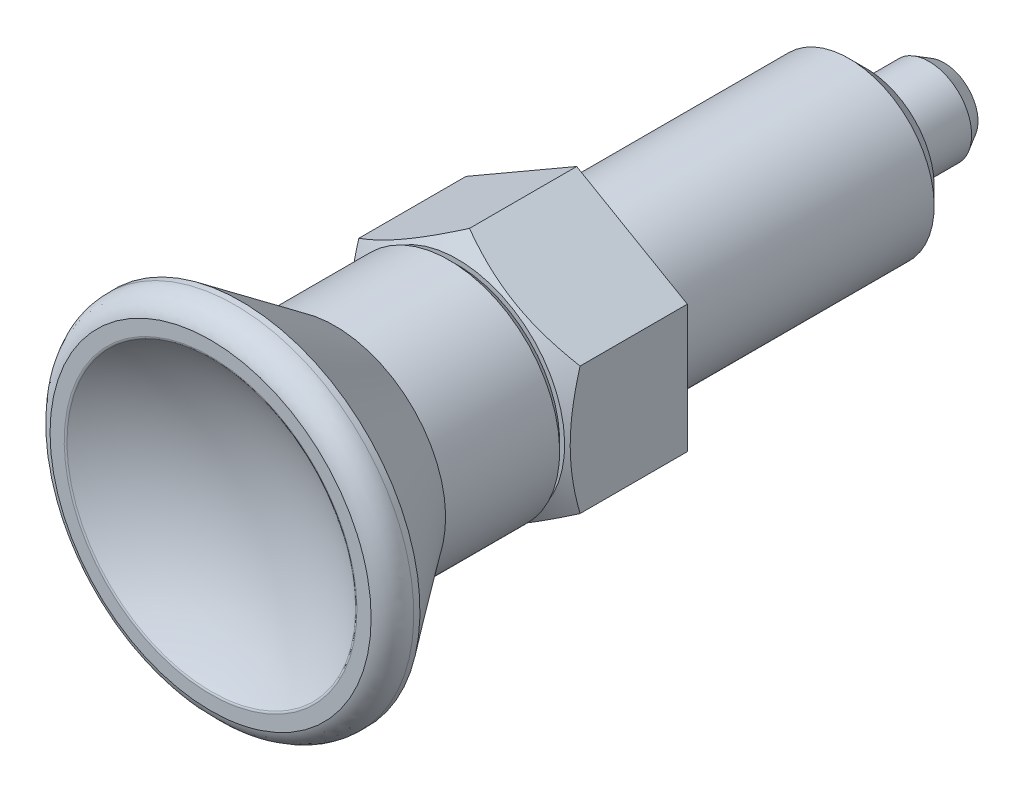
ISO-10303-21;
HEADER;
FILE_DESCRIPTION(('STEP AP214'),'2;1');
FILE_NAME('part.step','',(''),(''),'','','');
FILE_SCHEMA(('AUTOMOTIVE_DESIGN { 1 0 10303 214 1 1 1 1 }'));
ENDSEC;
DATA;
#1=APPLICATION_CONTEXT('core data for automotive mechanical design processes');
#2=APPLICATION_PROTOCOL_DEFINITION('international standard','automotive_design',2000,#1);
#3=PRODUCT_CONTEXT('',#1,'mechanical');
#4=PRODUCT('Part','Part','',(#3));
#5=PRODUCT_RELATED_PRODUCT_CATEGORY('part','',(#4));
#6=PRODUCT_DEFINITION_FORMATION('','',#4);
#7=PRODUCT_DEFINITION_CONTEXT('part definition',#1,'design');
#8=PRODUCT_DEFINITION('design','',#6,#7);
#9=PRODUCT_DEFINITION_SHAPE('','',#8);
#10=(LENGTH_UNIT() NAMED_UNIT(*) SI_UNIT(.MILLI.,.METRE.));
#11=(NAMED_UNIT(*) PLANE_ANGLE_UNIT() SI_UNIT($,.RADIAN.));
#12=(NAMED_UNIT(*) SI_UNIT($,.STERADIAN.) SOLID_ANGLE_UNIT());
#13=UNCERTAINTY_MEASURE_WITH_UNIT(LENGTH_MEASURE(1.E-05),#10,'distance_accuracy_value','');
#14=(GEOMETRIC_REPRESENTATION_CONTEXT(3) GLOBAL_UNCERTAINTY_ASSIGNED_CONTEXT((#13)) GLOBAL_UNIT_ASSIGNED_CONTEXT((#10,
#11,#12)) REPRESENTATION_CONTEXT('',''));
#15=CARTESIAN_POINT('',(0.,0.,0.));
#16=DIRECTION('',(0.,0.,1.));
#17=DIRECTION('',(1.,0.,0.));
#18=AXIS2_PLACEMENT_3D('',#15,#16,#17);
#19=CARTESIAN_POINT('',(0.,0.,-17.));
#20=DIRECTION('',(0.,0.,1.));
#21=DIRECTION('',(-0.866025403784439,0.5,0.));
#22=AXIS2_PLACEMENT_3D('',#19,#20,#21);
#23=CONICAL_SURFACE('',#22,4.,0.785398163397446);
#24=CARTESIAN_POINT('',(0.,0.,-16.));
#25=DIRECTION('',(0.,0.,1.));
#26=DIRECTION('',(-0.866025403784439,0.5,0.));
#27=AXIS2_PLACEMENT_3D('',#24,#25,#26);
#28=CIRCLE('',#27,5.);
#29=CARTESIAN_POINT('',(-4.33012701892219,2.49999999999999,-16.));
#30=VERTEX_POINT('',#29);
#31=EDGE_CURVE('E117',#30,#30,#28,.T.);
#32=ORIENTED_EDGE('',*,*,#31,.F.);
#33=EDGE_LOOP('',(#32));
#34=FACE_BOUND('',#33,.T.);
#35=CARTESIAN_POINT('',(0.,0.,-17.));
#36=DIRECTION('',(0.,0.,-1.));
#37=DIRECTION('',(-0.866025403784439,0.5,0.));
#38=AXIS2_PLACEMENT_3D('',#35,#36,#37);
#39=CIRCLE('',#38,4.);
#40=CARTESIAN_POINT('',(-3.46410161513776,1.99999999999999,-17.));
#41=VERTEX_POINT('',#40);
#42=EDGE_CURVE('E121',#41,#41,#39,.T.);
#43=ORIENTED_EDGE('',*,*,#42,.F.);
#44=EDGE_LOOP('',(#43));
#45=FACE_BOUND('',#44,.T.);
#46=ADVANCED_FACE('F14',(#34,#45),#23,.T.);
#47=CARTESIAN_POINT('',(0.,0.,0.));
#48=DIRECTION('',(0.,0.,-1.));
#49=DIRECTION('',(-0.866025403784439,0.5,0.));
#50=AXIS2_PLACEMENT_3D('',#47,#48,#49);
#51=CYLINDRICAL_SURFACE('',#50,5.);
#52=CARTESIAN_POINT('',(0.,0.,0.));
#53=DIRECTION('',(0.,0.,1.));
#54=DIRECTION('',(-0.866025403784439,0.5,0.));
#55=AXIS2_PLACEMENT_3D('',#52,#53,#54);
#56=CIRCLE('',#55,5.);
#57=CARTESIAN_POINT('',(-4.33012701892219,2.5,0.));
#58=VERTEX_POINT('',#57);
#59=EDGE_CURVE('E111',#58,#58,#56,.T.);
#60=ORIENTED_EDGE('',*,*,#59,.F.);
#61=EDGE_LOOP('',(#60));
#62=FACE_BOUND('',#61,.T.);
#63=ORIENTED_EDGE('',*,*,#31,.T.);
#64=EDGE_LOOP('',(#63));
#65=FACE_BOUND('',#64,.T.);
#66=ADVANCED_FACE('F176',(#62,#65),#51,.T.);
#67=CARTESIAN_POINT('',(-12.3236514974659,-1.54519052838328,0.));
#68=DIRECTION('',(0.,0.,-1.));
#69=DIRECTION('',(0.5,0.866025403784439,0.));
#70=AXIS2_PLACEMENT_3D('',#67,#68,#69);
#71=PLANE('',#70);
#72=DIRECTION('',(0.866025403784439,-0.5,0.));
#73=VECTOR('',#72,1.);
#74=CARTESIAN_POINT('',(0.,7.50555349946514,0.));
#75=LINE('',#74,#73);
#76=CARTESIAN_POINT('',(0.,7.50555349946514,0.));
#77=VERTEX_POINT('',#76);
#78=CARTESIAN_POINT('',(6.5,3.75277674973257,0.));
#79=VERTEX_POINT('',#78);
#80=EDGE_CURVE('E622',#77,#79,#75,.T.);
#81=ORIENTED_EDGE('',*,*,#80,.T.);
#82=DIRECTION('',(0.,-1.,0.));
#83=VECTOR('',#82,1.);
#84=CARTESIAN_POINT('',(6.5,3.75277674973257,0.));
#85=LINE('',#84,#83);
#86=CARTESIAN_POINT('',(6.5,-3.75277674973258,0.));
#87=VERTEX_POINT('',#86);
#88=EDGE_CURVE('E628',#79,#87,#85,.T.);
#89=ORIENTED_EDGE('',*,*,#88,.T.);
#90=DIRECTION('',(-0.866025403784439,-0.5,0.));
#91=VECTOR('',#90,1.);
#92=CARTESIAN_POINT('',(6.5,-3.75277674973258,0.));
#93=LINE('',#92,#91);
#94=CARTESIAN_POINT('',(0.,-7.50555349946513,0.));
#95=VERTEX_POINT('',#94);
#96=EDGE_CURVE('E81',#87,#95,#93,.T.);
#97=ORIENTED_EDGE('',*,*,#96,.T.);
#98=DIRECTION('',(-0.866025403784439,0.5,0.));
#99=VECTOR('',#98,1.);
#100=CARTESIAN_POINT('',(0.,-7.50555349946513,0.));
#101=LINE('',#100,#99);
#102=CARTESIAN_POINT('',(-6.5,-3.75277674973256,0.));
#103=VERTEX_POINT('',#102);
#104=EDGE_CURVE('E86',#95,#103,#101,.T.);
#105=ORIENTED_EDGE('',*,*,#104,.T.);
#106=DIRECTION('',(0.,1.,0.));
#107=VECTOR('',#106,1.);
#108=CARTESIAN_POINT('',(-6.5,-3.75277674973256,0.));
#109=LINE('',#108,#107);
#110=CARTESIAN_POINT('',(-6.5,3.75277674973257,0.));
#111=VERTEX_POINT('',#110);
#112=EDGE_CURVE('E90',#103,#111,#109,.T.);
#113=ORIENTED_EDGE('',*,*,#112,.T.);
#114=DIRECTION('',(0.866025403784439,0.5,0.));
#115=VECTOR('',#114,1.);
#116=CARTESIAN_POINT('',(-6.5,3.75277674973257,0.));
#117=LINE('',#116,#115);
#118=EDGE_CURVE('E106',#111,#77,#117,.T.);
#119=ORIENTED_EDGE('',*,*,#118,.T.);
#120=EDGE_LOOP('',(#81,#89,#97,#105,#113,#119));
#121=FACE_BOUND('',#120,.T.);
#122=ORIENTED_EDGE('',*,*,#59,.T.);
#123=EDGE_LOOP('',(#122));
#124=FACE_BOUND('',#123,.T.);
#125=ADVANCED_FACE('F87',(#121,#124),#71,.T.);
#126=CARTESIAN_POINT('',(6.5,3.75277674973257,7.));
#127=DIRECTION('',(-0.5,-0.866025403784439,0.));
#128=DIRECTION('',(-0.866025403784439,0.5,0.));
#129=AXIS2_PLACEMENT_3D('',#126,#127,#128);
#130=PLANE('',#129);
#131=DIRECTION('',(0.,0.,-1.));
#132=VECTOR('',#131,1.);
#133=CARTESIAN_POINT('',(6.5,3.75277674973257,6.3));
#134=LINE('',#133,#132);
#135=CARTESIAN_POINT('',(6.5,3.75277674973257,6.3));
#136=VERTEX_POINT('',#135);
#137=EDGE_CURVE('E588',#136,#79,#134,.T.);
#138=ORIENTED_EDGE('',*,*,#137,.T.);
#139=ORIENTED_EDGE('',*,*,#80,.F.);
#140=DIRECTION('',(0.,0.,1.));
#141=VECTOR('',#140,1.);
#142=CARTESIAN_POINT('',(0.,7.50555349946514,0.));
#143=LINE('',#142,#141);
#144=CARTESIAN_POINT('',(0.,7.50555349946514,6.3));
#145=VERTEX_POINT('',#144);
#146=EDGE_CURVE('E595',#77,#145,#143,.T.);
#147=ORIENTED_EDGE('',*,*,#146,.T.);
#148=CARTESIAN_POINT('',(6.5,3.75277674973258,6.3));
#149=CARTESIAN_POINT('',(3.25,5.62916512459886,7.38333333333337));
#150=CARTESIAN_POINT('',(0.,7.50555349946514,6.3));
#151=(BOUNDED_CURVE() B_SPLINE_CURVE(2,(#148,#149,#150),.UNSPECIFIED.,.F.,
.F.) B_SPLINE_CURVE_WITH_KNOTS((3,3),(0.,1.),
.UNSPECIFIED.) CURVE() GEOMETRIC_REPRESENTATION_ITEM() RATIONAL_B_SPLINE_CURVE((1.,
1.15470053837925,1.)) REPRESENTATION_ITEM(''));
#152=EDGE_CURVE('E574',#136,#145,#151,.T.);
#153=ORIENTED_EDGE('',*,*,#152,.F.);
#154=EDGE_LOOP('',(#138,#139,#147,#153));
#155=FACE_BOUND('',#154,.T.);
#156=ADVANCED_FACE('F323',(#155),#130,.F.);
#157=CARTESIAN_POINT('',(6.5,-3.75277674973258,7.));
#158=DIRECTION('',(-1.,0.,0.));
#159=DIRECTION('',(0.,1.,0.));
#160=AXIS2_PLACEMENT_3D('',#157,#158,#159);
#161=PLANE('',#160);
#162=DIRECTION('',(0.,0.,-1.));
#163=VECTOR('',#162,1.);
#164=CARTESIAN_POINT('',(6.5,-3.75277674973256,6.3));
#165=LINE('',#164,#163);
#166=CARTESIAN_POINT('',(6.5,-3.75277674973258,6.3));
#167=VERTEX_POINT('',#166);
#168=EDGE_CURVE('E602',#167,#87,#165,.T.);
#169=ORIENTED_EDGE('',*,*,#168,.T.);
#170=ORIENTED_EDGE('',*,*,#88,.F.);
#171=ORIENTED_EDGE('',*,*,#137,.F.);
#172=CARTESIAN_POINT('',(6.5,-3.75277674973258,6.3));
#173=CARTESIAN_POINT('',(6.49999999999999,0.,7.38333333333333));
#174=CARTESIAN_POINT('',(6.5,3.75277674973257,6.3));
#175=(BOUNDED_CURVE() B_SPLINE_CURVE(2,(#172,#173,#174),.UNSPECIFIED.,.F.,
.F.) B_SPLINE_CURVE_WITH_KNOTS((3,3),(0.,1.),
.UNSPECIFIED.) CURVE() GEOMETRIC_REPRESENTATION_ITEM() RATIONAL_B_SPLINE_CURVE((1.,
1.15470053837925,1.)) REPRESENTATION_ITEM(''));
#176=EDGE_CURVE('E567',#167,#136,#175,.T.);
#177=ORIENTED_EDGE('',*,*,#176,.F.);
#178=EDGE_LOOP('',(#169,#170,#171,#177));
#179=FACE_BOUND('',#178,.T.);
#180=ADVANCED_FACE('F347',(#179),#161,.F.);
#181=CARTESIAN_POINT('',(0.,-7.50555349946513,7.));
#182=DIRECTION('',(-0.5,0.866025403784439,0.));
#183=DIRECTION('',(0.866025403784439,0.5,0.));
#184=AXIS2_PLACEMENT_3D('',#181,#182,#183);
#185=PLANE('',#184);
#186=DIRECTION('',(0.,0.,-1.));
#187=VECTOR('',#186,1.);
#188=CARTESIAN_POINT('',(0.,-7.50555349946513,6.3));
#189=LINE('',#188,#187);
#190=CARTESIAN_POINT('',(0.,-7.50555349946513,6.3));
#191=VERTEX_POINT('',#190);
#192=EDGE_CURVE('E99',#191,#95,#189,.T.);
#193=ORIENTED_EDGE('',*,*,#192,.T.);
#194=ORIENTED_EDGE('',*,*,#96,.F.);
#195=ORIENTED_EDGE('',*,*,#168,.F.);
#196=CARTESIAN_POINT('',(0.,-7.50555349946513,6.3));
#197=CARTESIAN_POINT('',(3.25,-5.62916512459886,7.38333333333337));
#198=CARTESIAN_POINT('',(6.5,-3.75277674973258,6.3));
#199=(BOUNDED_CURVE() B_SPLINE_CURVE(2,(#196,#197,#198),.UNSPECIFIED.,.F.,
.F.) B_SPLINE_CURVE_WITH_KNOTS((3,3),(0.,1.),
.UNSPECIFIED.) CURVE() GEOMETRIC_REPRESENTATION_ITEM() RATIONAL_B_SPLINE_CURVE((1.,
1.15470053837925,1.)) REPRESENTATION_ITEM(''));
#200=EDGE_CURVE('E560',#191,#167,#199,.T.);
#201=ORIENTED_EDGE('',*,*,#200,.F.);
#202=EDGE_LOOP('',(#193,#194,#195,#201));
#203=FACE_BOUND('',#202,.T.);
#204=ADVANCED_FACE('F359',(#203),#185,.F.);
#205=CARTESIAN_POINT('',(-6.5,-3.75277674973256,7.));
#206=DIRECTION('',(0.5,0.866025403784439,0.));
#207=DIRECTION('',(0.866025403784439,-0.5,0.));
#208=AXIS2_PLACEMENT_3D('',#205,#206,#207);
#209=PLANE('',#208);
#210=DIRECTION('',(0.,0.,-1.));
#211=VECTOR('',#210,1.);
#212=CARTESIAN_POINT('',(-6.5,-3.75277674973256,6.3));
#213=LINE('',#212,#211);
#214=CARTESIAN_POINT('',(-6.5,-3.75277674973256,6.3));
#215=VERTEX_POINT('',#214);
#216=EDGE_CURVE('E94',#215,#103,#213,.T.);
#217=ORIENTED_EDGE('',*,*,#216,.T.);
#218=ORIENTED_EDGE('',*,*,#104,.F.);
#219=ORIENTED_EDGE('',*,*,#192,.F.);
#220=CARTESIAN_POINT('',(-6.5,-3.75277674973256,6.3));
#221=CARTESIAN_POINT('',(-3.25000000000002,-5.62916512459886,7.38333333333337));
#222=CARTESIAN_POINT('',(0.,-7.50555349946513,6.3));
#223=(BOUNDED_CURVE() B_SPLINE_CURVE(2,(#220,#221,#222),.UNSPECIFIED.,.F.,
.F.) B_SPLINE_CURVE_WITH_KNOTS((3,3),(0.,1.),
.UNSPECIFIED.) CURVE() GEOMETRIC_REPRESENTATION_ITEM() RATIONAL_B_SPLINE_CURVE((1.,
1.15470053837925,1.)) REPRESENTATION_ITEM(''));
#224=EDGE_CURVE('E39',#215,#191,#223,.T.);
#225=ORIENTED_EDGE('',*,*,#224,.F.);
#226=EDGE_LOOP('',(#217,#218,#219,#225));
#227=FACE_BOUND('',#226,.T.);
#228=ADVANCED_FACE('F95',(#227),#209,.F.);
#229=CARTESIAN_POINT('',(-6.5,3.75277674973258,7.));
#230=DIRECTION('',(1.,0.,0.));
#231=DIRECTION('',(0.,-1.,0.));
#232=AXIS2_PLACEMENT_3D('',#229,#230,#231);
#233=PLANE('',#232);
#234=DIRECTION('',(0.,0.,-1.));
#235=VECTOR('',#234,1.);
#236=CARTESIAN_POINT('',(-6.5,3.75277674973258,6.3));
#237=LINE('',#236,#235);
#238=CARTESIAN_POINT('',(-6.5,3.75277674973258,6.3));
#239=VERTEX_POINT('',#238);
#240=EDGE_CURVE('E100',#239,#111,#237,.T.);
#241=ORIENTED_EDGE('',*,*,#240,.T.);
#242=ORIENTED_EDGE('',*,*,#112,.F.);
#243=ORIENTED_EDGE('',*,*,#216,.F.);
#244=CARTESIAN_POINT('',(-6.5,3.75277674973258,6.3));
#245=CARTESIAN_POINT('',(-6.5,0.,7.38333333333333));
#246=CARTESIAN_POINT('',(-6.5,-3.75277674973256,6.3));
#247=(BOUNDED_CURVE() B_SPLINE_CURVE(2,(#244,#245,#246),.UNSPECIFIED.,.F.,
.F.) B_SPLINE_CURVE_WITH_KNOTS((3,3),(0.,1.),
.UNSPECIFIED.) CURVE() GEOMETRIC_REPRESENTATION_ITEM() RATIONAL_B_SPLINE_CURVE((1.,
1.15470053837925,1.)) REPRESENTATION_ITEM(''));
#248=EDGE_CURVE('E549',#239,#215,#247,.T.);
#249=ORIENTED_EDGE('',*,*,#248,.F.);
#250=EDGE_LOOP('',(#241,#242,#243,#249));
#251=FACE_BOUND('',#250,.T.);
#252=ADVANCED_FACE('F103',(#251),#233,.F.);
#253=CARTESIAN_POINT('',(0.,7.50555349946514,7.));
#254=DIRECTION('',(0.5,-0.866025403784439,0.));
#255=DIRECTION('',(-0.866025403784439,-0.5,0.));
#256=AXIS2_PLACEMENT_3D('',#253,#254,#255);
#257=PLANE('',#256);
#258=ORIENTED_EDGE('',*,*,#146,.F.);
#259=ORIENTED_EDGE('',*,*,#118,.F.);
#260=ORIENTED_EDGE('',*,*,#240,.F.);
#261=CARTESIAN_POINT('',(0.,7.50555349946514,6.3));
#262=CARTESIAN_POINT('',(-3.25,5.62916512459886,7.38333333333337));
#263=CARTESIAN_POINT('',(-6.5,3.75277674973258,6.3));
#264=(BOUNDED_CURVE() B_SPLINE_CURVE(2,(#261,#262,#263),.UNSPECIFIED.,.F.,
.F.) B_SPLINE_CURVE_WITH_KNOTS((3,3),(0.,1.),
.UNSPECIFIED.) CURVE() GEOMETRIC_REPRESENTATION_ITEM() RATIONAL_B_SPLINE_CURVE((1.,
1.15470053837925,1.)) REPRESENTATION_ITEM(''));
#265=EDGE_CURVE('E581',#145,#239,#264,.T.);
#266=ORIENTED_EDGE('',*,*,#265,.F.);
#267=EDGE_LOOP('',(#258,#259,#260,#266));
#268=FACE_BOUND('',#267,.T.);
#269=ADVANCED_FACE('F324',(#268),#257,.F.);
#270=CARTESIAN_POINT('',(0.,0.,7.));
#271=DIRECTION('',(0.,0.,-1.));
#272=DIRECTION('',(-0.866025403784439,0.5,0.));
#273=AXIS2_PLACEMENT_3D('',#270,#271,#272);
#274=CONICAL_SURFACE('',#273,6.29311793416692,1.0471975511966);
#275=ORIENTED_EDGE('',*,*,#248,.T.);
#276=ORIENTED_EDGE('',*,*,#224,.T.);
#277=ORIENTED_EDGE('',*,*,#200,.T.);
#278=ORIENTED_EDGE('',*,*,#176,.T.);
#279=ORIENTED_EDGE('',*,*,#152,.T.);
#280=ORIENTED_EDGE('',*,*,#265,.T.);
#281=EDGE_LOOP('',(#275,#276,#277,#278,#279,#280));
#282=FACE_BOUND('',#281,.T.);
#283=CARTESIAN_POINT('',(0.,0.,7.));
#284=DIRECTION('',(0.,0.,1.));
#285=DIRECTION('',(-0.866025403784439,0.5,0.));
#286=AXIS2_PLACEMENT_3D('',#283,#284,#285);
#287=CIRCLE('',#286,6.29311793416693);
#288=CARTESIAN_POINT('',(-5.45000000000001,3.14655896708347,7.));
#289=VERTEX_POINT('',#288);
#290=EDGE_CURVE('E128',#289,#289,#287,.T.);
#291=ORIENTED_EDGE('',*,*,#290,.F.);
#292=EDGE_LOOP('',(#291));
#293=FACE_BOUND('',#292,.T.);
#294=ADVANCED_FACE('F334',(#282,#293),#274,.T.);
#295=CARTESIAN_POINT('',(2.56602540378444,-10.1417494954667,7.));
#296=DIRECTION('',(0.,0.,1.));
#297=DIRECTION('',(0.5,0.866025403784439,0.));
#298=AXIS2_PLACEMENT_3D('',#295,#296,#297);
#299=PLANE('',#298);
#300=CARTESIAN_POINT('',(5.74570081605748E-13,-3.2330803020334E-13,7.));
#301=DIRECTION('',(0.,0.,1.));
#302=DIRECTION('',(0.5,0.866025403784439,0.));
#303=AXIS2_PLACEMENT_3D('',#300,#301,#302);
#304=CIRCLE('',#303,6.);
#305=CARTESIAN_POINT('',(3.00000000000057,5.19615242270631,7.));
#306=VERTEX_POINT('',#305);
#307=EDGE_CURVE('E126',#306,#306,#304,.T.);
#308=ORIENTED_EDGE('',*,*,#307,.F.);
#309=EDGE_LOOP('',(#308));
#310=FACE_BOUND('',#309,.T.);
#311=ORIENTED_EDGE('',*,*,#290,.T.);
#312=EDGE_LOOP('',(#311));
#313=FACE_BOUND('',#312,.T.);
#314=ADVANCED_FACE('F400',(#310,#313),#299,.T.);
#315=CARTESIAN_POINT('',(5.73336933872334E-13,-3.25443904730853E-13,7.));
#316=DIRECTION('',(0.,0.,1.));
#317=DIRECTION('',(-0.866025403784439,0.5,0.));
#318=AXIS2_PLACEMENT_3D('',#315,#316,#317);
#319=CONICAL_SURFACE('',#318,6.,0.785398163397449);
#320=CARTESIAN_POINT('',(5.83043334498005E-13,-3.25876398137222E-13,7.5));
#321=DIRECTION('',(0.,0.,1.));
#322=DIRECTION('',(-0.866025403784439,0.5,0.));
#323=AXIS2_PLACEMENT_3D('',#320,#321,#322);
#324=CIRCLE('',#323,6.5);
#325=CARTESIAN_POINT('',(-5.62916512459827,3.24999999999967,7.5));
#326=VERTEX_POINT('',#325);
#327=EDGE_CURVE('E125',#326,#326,#324,.T.);
#328=ORIENTED_EDGE('',*,*,#327,.F.);
#329=EDGE_LOOP('',(#328));
#330=FACE_BOUND('',#329,.T.);
#331=ORIENTED_EDGE('',*,*,#307,.T.);
#332=EDGE_LOOP('',(#331));
#333=FACE_BOUND('',#332,.T.);
#334=ADVANCED_FACE('F411',(#330,#333),#319,.T.);
#335=CARTESIAN_POINT('',(5.77023594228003E-13,-3.22087798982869E-13,14.2));
#336=DIRECTION('',(0.,0.,-1.));
#337=DIRECTION('',(-0.866025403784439,0.5,0.));
#338=AXIS2_PLACEMENT_3D('',#335,#336,#337);
#339=CYLINDRICAL_SURFACE('',#338,6.5);
#340=ORIENTED_EDGE('',*,*,#327,.T.);
#341=EDGE_LOOP('',(#340));
#342=FACE_BOUND('',#341,.T.);
#343=CARTESIAN_POINT('',(5.75667337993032E-13,-3.21304764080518E-13,14.2));
#344=DIRECTION('',(0.,0.,-1.));
#345=DIRECTION('',(-0.866025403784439,0.5,0.));
#346=AXIS2_PLACEMENT_3D('',#343,#344,#345);
#347=CIRCLE('',#346,6.5);
#348=CARTESIAN_POINT('',(-5.62916512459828,3.24999999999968,14.2));
#349=VERTEX_POINT('',#348);
#350=EDGE_CURVE('E661',#349,#349,#347,.T.);
#351=ORIENTED_EDGE('',*,*,#350,.T.);
#352=EDGE_LOOP('',(#351));
#353=FACE_BOUND('',#352,.T.);
#354=ADVANCED_FACE('F475',(#342,#353),#339,.T.);
#355=CARTESIAN_POINT('',(5.74960431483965E-13,-3.22529162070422E-13,14.2));
#356=DIRECTION('',(0.,0.,1.));
#357=DIRECTION('',(-0.866025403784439,0.5,0.));
#358=AXIS2_PLACEMENT_3D('',#355,#356,#357);
#359=CONICAL_SURFACE('',#358,6.5,0.628318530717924);
#360=CARTESIAN_POINT('',(5.74363739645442E-13,-3.20093215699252E-13,19.7055276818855));
#361=DIRECTION('',(0.,0.,-1.));
#362=DIRECTION('',(-0.866025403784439,0.5,0.));
#363=AXIS2_PLACEMENT_3D('',#360,#361,#362);
#364=CIRCLE('',#363,10.5);
#365=CARTESIAN_POINT('',(-9.09326673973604,5.24999999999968,19.7055276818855));
#366=VERTEX_POINT('',#365);
#367=EDGE_CURVE('E668',#366,#366,#364,.T.);
#368=ORIENTED_EDGE('',*,*,#367,.T.);
#369=EDGE_LOOP('',(#368));
#370=FACE_BOUND('',#369,.T.);
#371=ORIENTED_EDGE('',*,*,#350,.F.);
#372=EDGE_LOOP('',(#371));
#373=FACE_BOUND('',#372,.T.);
#374=ADVANCED_FACE('F463',(#370,#373),#359,.T.);
#375=CARTESIAN_POINT('',(5.75905884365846E-13,-3.17484739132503E-13,20.0689935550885));
#376=DIRECTION('',(0.,0.,-1.));
#377=DIRECTION('',(-0.866025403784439,0.5,0.));
#378=AXIS2_PLACEMENT_3D('',#375,#376,#377);
#379=CYLINDRICAL_SURFACE('',#378,10.5);
#380=CARTESIAN_POINT('',(5.7399591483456E-13,-3.17260860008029E-13,20.0689935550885));
#381=DIRECTION('',(0.,0.,-1.));
#382=DIRECTION('',(-0.866025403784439,0.5,0.));
#383=AXIS2_PLACEMENT_3D('',#380,#381,#382);
#384=CIRCLE('',#383,10.5);
#385=CARTESIAN_POINT('',(-9.09326673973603,5.24999999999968,20.0689935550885));
#386=VERTEX_POINT('',#385);
#387=EDGE_CURVE('E675',#386,#386,#384,.T.);
#388=ORIENTED_EDGE('',*,*,#387,.T.);
#389=EDGE_LOOP('',(#388));
#390=FACE_BOUND('',#389,.T.);
#391=ORIENTED_EDGE('',*,*,#367,.F.);
#392=EDGE_LOOP('',(#391));
#393=FACE_BOUND('',#392,.T.);
#394=ADVANCED_FACE('F451',(#390,#393),#379,.T.);
#395=CARTESIAN_POINT('',(-8.16809662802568,4.71585278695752,21.5055276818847));
#396=CARTESIAN_POINT('',(-9.09326673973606,5.2499999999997,21.1844850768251));
#397=CARTESIAN_POINT('',(-9.09326673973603,5.24999999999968,20.0689935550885));
#398=CARTESIAN_POINT('',(5.759281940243E-13,18.863411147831,21.5055276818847));
#399=CARTESIAN_POINT('',(5.83692591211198E-13,20.9999999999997,21.1844850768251));
#400=CARTESIAN_POINT('',(5.86336534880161E-13,20.9999999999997,20.0689935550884));
#401=CARTESIAN_POINT('',(8.16809662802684,4.71585278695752,21.5055276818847));
#402=CARTESIAN_POINT('',(9.0932667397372,5.2499999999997,21.1844850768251));
#403=CARTESIAN_POINT('',(9.09326673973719,5.24999999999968,20.0689935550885));
#404=CARTESIAN_POINT('',(16.3361932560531,-9.431705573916,21.5055276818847));
#405=CARTESIAN_POINT('',(18.1865334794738,-10.5000000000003,21.1844850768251));
#406=CARTESIAN_POINT('',(18.1865334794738,-10.5000000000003,20.0689935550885));
#407=CARTESIAN_POINT('',(5.78530279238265E-13,-9.431705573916,21.5055276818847));
#408=CARTESIAN_POINT('',(5.81530766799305E-13,-10.5000000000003,21.1844850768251));
#409=CARTESIAN_POINT('',(5.73326108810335E-13,-10.5000000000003,20.0689935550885));
#410=CARTESIAN_POINT('',(-16.3361932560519,-9.431705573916,21.5055276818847));
#411=CARTESIAN_POINT('',(-18.1865334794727,-10.5000000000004,21.1844850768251));
#412=CARTESIAN_POINT('',(-18.1865334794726,-10.5000000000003,20.0689935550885));
#413=CARTESIAN_POINT('',(-8.16809662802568,4.71585278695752,21.5055276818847));
#414=CARTESIAN_POINT('',(-9.09326673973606,5.2499999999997,21.1844850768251));
#415=CARTESIAN_POINT('',(-9.09326673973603,5.24999999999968,20.0689935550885));
#416=(BOUNDED_SURFACE() B_SPLINE_SURFACE(2,2,((#395,#396,#397),(#398,#399,#400),(#401,#402,
#403),(#404,#405,#406),(#407,#408,#409),(#410,#411,#412),(#413,#414,#415)),.UNSPECIFIED.,.T.,
.F.,.F.) B_SPLINE_SURFACE_WITH_KNOTS((3,2,2,3),(3,3),(0.,15.8434592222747,31.6869184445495,
47.5303776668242),(0.,1.),
.UNSPECIFIED.) GEOMETRIC_REPRESENTATION_ITEM() RATIONAL_B_SPLINE_SURFACE(((1.,0.802434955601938,
1.),(0.5,0.401217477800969,0.5),(1.,0.802434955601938,1.),(0.5,0.401217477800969,0.5),(1.,
0.802434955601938,1.),(0.5,0.401217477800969,0.5),(1.,0.802434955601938,1.))) REPRESENTATION_ITEM('') SURFACE());
#417=CARTESIAN_POINT('',(5.77059939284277E-13,-3.18892707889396E-13,21.5055276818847));
#418=DIRECTION('',(0.,0.,-1.));
#419=DIRECTION('',(-0.866025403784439,0.5,0.));
#420=AXIS2_PLACEMENT_3D('',#417,#418,#419);
#421=CIRCLE('',#420,9.43170557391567);
#422=CARTESIAN_POINT('',(-8.16809662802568,4.71585278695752,21.5055276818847));
#423=VERTEX_POINT('',#422);
#424=EDGE_CURVE('E682',#423,#423,#421,.T.);
#425=CARTESIAN_POINT('',(-8.16809662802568,4.71585278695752,21.5055276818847));
#426=CARTESIAN_POINT('',(-8.17196918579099,4.71808860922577,21.5041838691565));
#427=CARTESIAN_POINT('',(-8.1758363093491,4.72032129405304,21.5028191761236));
#428=CARTESIAN_POINT('',(-8.18357113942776,4.72478700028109,21.5000439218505));
#429=CARTESIAN_POINT('',(-8.18743881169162,4.72702000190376,21.4986332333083));
#430=CARTESIAN_POINT('',(-8.19517418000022,4.73148601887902,21.4957657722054));
#431=CARTESIAN_POINT('',(-8.19904184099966,4.73371901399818,21.4943088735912));
#432=CARTESIAN_POINT('',(-8.20677662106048,4.73818469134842,21.4913487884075));
#433=CARTESIAN_POINT('',(-8.2106437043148,4.74041735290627,21.489845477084));
#434=CARTESIAN_POINT('',(-8.21837675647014,4.74488203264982,21.4867923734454));
#435=CARTESIAN_POINT('',(-8.22224268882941,4.74711402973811,21.4852424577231));
#436=CARTESIAN_POINT('',(-8.229972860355,4.75157704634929,21.4820959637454));
#437=CARTESIAN_POINT('',(-8.23383706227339,4.75380804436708,21.4804992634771));
#438=CARTESIAN_POINT('',(-8.24156318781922,4.75826872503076,21.4772590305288));
#439=CARTESIAN_POINT('',(-8.24542507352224,4.76049838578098,21.4756153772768));
#440=CARTESIAN_POINT('',(-8.25314597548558,4.76495605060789,21.4722810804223));
#441=CARTESIAN_POINT('',(-8.2570049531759,4.7671840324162,21.4705903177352));
#442=CARTESIAN_POINT('',(-8.26471944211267,4.7716379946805,21.4671616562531));
#443=CARTESIAN_POINT('',(-8.26857491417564,4.77386395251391,21.465423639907));
#444=CARTESIAN_POINT('',(-8.27628178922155,4.77831351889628,21.4619003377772));
#445=CARTESIAN_POINT('',(-8.28013315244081,4.78053710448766,21.4601149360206));
#446=CARTESIAN_POINT('',(-8.28783120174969,4.78498157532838,21.4564967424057));
#447=CARTESIAN_POINT('',(-8.2916778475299,4.78720243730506,21.4546638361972));
#448=CARTESIAN_POINT('',(-8.29936584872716,4.79164110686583,21.4509505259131));
#449=CARTESIAN_POINT('',(-8.30320716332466,4.79385889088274,21.4490700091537));
#450=CARTESIAN_POINT('',(-8.31088388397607,4.79829104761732,21.4452613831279));
#451=CARTESIAN_POINT('',(-8.31471924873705,4.80050539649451,21.4433331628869));
#452=CARTESIAN_POINT('',(-8.32238344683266,4.80493032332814,21.4394290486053));
#453=CARTESIAN_POINT('',(-8.32621223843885,4.80714087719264,21.4374530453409));
#454=CARTESIAN_POINT('',(-8.33386266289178,4.81155785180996,21.4334532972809));
#455=CARTESIAN_POINT('',(-8.33768425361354,4.8137642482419,21.4314294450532));
#456=CARTESIAN_POINT('',(-8.34531964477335,4.81817254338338,21.4273339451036));
#457=CARTESIAN_POINT('',(-8.34913340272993,4.82037441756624,21.4252621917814));
#458=CARTESIAN_POINT('',(-8.35675249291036,4.82477330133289,21.4210708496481));
#459=CARTESIAN_POINT('',(-8.36055778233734,4.8269702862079,21.4189511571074));
#460=CARTESIAN_POINT('',(-8.36815929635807,4.83135902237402,21.4146639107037));
#461=CARTESIAN_POINT('',(-8.37195547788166,4.83355074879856,21.4124962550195));
#462=CARTESIAN_POINT('',(-8.37953813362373,4.83792859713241,21.408113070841));
#463=CARTESIAN_POINT('',(-8.3833245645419,4.84011469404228,21.4058974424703));
#464=CARTESIAN_POINT('',(-8.39088707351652,4.84448091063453,21.4014183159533));
#465=CARTESIAN_POINT('',(-8.39466310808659,4.84666100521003,21.3991547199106));
#466=CARTESIAN_POINT('',(-8.4022041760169,4.85101484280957,21.3945796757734));
#467=CARTESIAN_POINT('',(-8.40596916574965,4.85318856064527,21.3922681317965));
#468=CARTESIAN_POINT('',(-8.41348749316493,4.85752926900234,21.3875972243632));
#469=CARTESIAN_POINT('',(-8.41724078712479,4.85969623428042,21.3852377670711));
#470=CARTESIAN_POINT('',(-8.42473506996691,4.86402306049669,21.3804710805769));
#471=CARTESIAN_POINT('',(-8.42847601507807,4.86618289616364,21.3780637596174));
#472=CARTESIAN_POINT('',(-8.43594494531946,4.87049508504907,21.3732014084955));
#473=CARTESIAN_POINT('',(-8.43967288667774,4.8726474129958,21.3707462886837));
#474=CARTESIAN_POINT('',(-8.4471151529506,4.87694420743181,21.3657884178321));
#475=CARTESIAN_POINT('',(-8.45082943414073,4.87908864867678,21.363285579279));
#476=CARTESIAN_POINT('',(-8.45824372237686,4.88336928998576,21.3582323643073));
#477=CARTESIAN_POINT('',(-8.46194368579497,4.8855054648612,21.3556819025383));
#478=CARTESIAN_POINT('',(-8.46932867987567,4.88976919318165,21.350533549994));
#479=CARTESIAN_POINT('',(-8.47301366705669,4.89189672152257,21.3479355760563));
#480=CARTESIAN_POINT('',(-8.48036804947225,4.89614277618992,21.3426923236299));
#481=CARTESIAN_POINT('',(-8.48403740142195,4.89826127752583,21.3400469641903));
#482=CARTESIAN_POINT('',(-8.49135985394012,4.90248889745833,21.3347090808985));
#483=CARTESIAN_POINT('',(-8.49501291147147,4.90459799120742,21.3320164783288));
#484=CARTESIAN_POINT('',(-8.50230211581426,4.9088064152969,21.3265842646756));
#485=CARTESIAN_POINT('',(-8.50593821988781,4.91090572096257,21.3238445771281));
#486=CARTESIAN_POINT('',(-8.51319285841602,4.9150941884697,21.3183183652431));
#487=CARTESIAN_POINT('',(-8.51681135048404,4.91718332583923,21.3155317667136));
#488=CARTESIAN_POINT('',(-8.5240301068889,4.9213510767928,21.3099119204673));
#489=CARTESIAN_POINT('',(-8.52763032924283,4.92342966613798,21.307078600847));
#490=CARTESIAN_POINT('',(-8.53481188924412,4.92757594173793,21.3013655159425));
#491=CARTESIAN_POINT('',(-8.53839318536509,4.92964360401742,21.2984856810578));
#492=CARTESIAN_POINT('',(-8.54553623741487,4.9337676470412,21.2926797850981));
#493=CARTESIAN_POINT('',(-8.54909795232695,4.93582400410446,21.2897536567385));
#494=CARTESIAN_POINT('',(-8.55620118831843,4.93992505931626,21.2838554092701));
#495=CARTESIAN_POINT('',(-8.55974266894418,4.94196973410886,21.2808832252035));
#496=CARTESIAN_POINT('',(-8.56680478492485,4.94604704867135,21.2748931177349));
#497=CARTESIAN_POINT('',(-8.57032538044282,4.94807966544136,21.2718751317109));
#498=CARTESIAN_POINT('',(-8.57734507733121,4.9521324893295,21.2657936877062));
#499=CARTESIAN_POINT('',(-8.58084413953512,4.95415267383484,21.2627301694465));
#500=CARTESIAN_POINT('',(-8.58782012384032,4.95818026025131,21.2565579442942));
#501=CARTESIAN_POINT('',(-8.59129700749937,4.9601876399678,21.2534491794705));
#502=CARTESIAN_POINT('',(-8.59822799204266,4.96418924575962,21.247186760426));
#503=CARTESIAN_POINT('',(-8.60168205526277,4.96618345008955,21.2440330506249));
#504=CARTESIAN_POINT('',(-8.60856675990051,4.97015833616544,21.2376810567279));
#505=CARTESIAN_POINT('',(-8.61199736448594,4.97213899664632,21.2344827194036));
#506=CARTESIAN_POINT('',(-8.61883451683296,4.97608642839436,21.2280418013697));
#507=CARTESIAN_POINT('',(-8.62224102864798,4.97805317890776,21.2247991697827));
#508=CARTESIAN_POINT('',(-8.6290293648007,4.98197242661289,21.2182700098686));
#509=CARTESIAN_POINT('',(-8.63241115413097,4.98392490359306,21.2149834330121));
#510=CARTESIAN_POINT('',(-8.63914941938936,4.98781524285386,21.2083667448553));
#511=CARTESIAN_POINT('',(-8.64250586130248,4.98975308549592,21.2050365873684));
#512=CARTESIAN_POINT('',(-8.64919281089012,4.9936137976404,21.1983331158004));
#513=CARTESIAN_POINT('',(-8.65252328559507,4.99553664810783,21.1949597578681));
#514=CARTESIAN_POINT('',(-8.65915768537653,4.99936702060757,21.1881702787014));
#515=CARTESIAN_POINT('',(-8.66246157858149,5.00127452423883,21.1847541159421));
#516=CARTESIAN_POINT('',(-8.66904220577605,5.00507385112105,21.1778794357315));
#517=CARTESIAN_POINT('',(-8.67231890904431,5.00696565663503,21.1744208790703));
#518=CARTESIAN_POINT('',(-8.67884455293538,5.01073323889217,21.1674618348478));
#519=CARTESIAN_POINT('',(-8.68209346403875,5.01260899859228,21.1639613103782));
#520=CARTESIAN_POINT('',(-8.68856292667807,5.01634414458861,21.156918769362));
#521=CARTESIAN_POINT('',(-8.69178344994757,5.01820351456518,21.1533767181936));
#522=CARTESIAN_POINT('',(-8.69819554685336,5.02190554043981,21.1462515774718));
#523=CARTESIAN_POINT('',(-8.70138709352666,5.02374818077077,21.1426684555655));
#524=CARTESIAN_POINT('',(-8.7077406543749,5.02741641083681,21.1354616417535));
#525=CARTESIAN_POINT('',(-8.71090264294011,5.02924198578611,21.1318379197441));
#526=CARTESIAN_POINT('',(-8.71719651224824,5.03287575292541,21.1245503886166));
#527=CARTESIAN_POINT('',(-8.7203283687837,5.03468393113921,21.1208865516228));
#528=CARTESIAN_POINT('',(-8.72656140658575,5.0382825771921,21.1135192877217));
#529=CARTESIAN_POINT('',(-8.72966256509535,5.04007303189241,21.109815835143));
#530=CARTESIAN_POINT('',(-8.73583364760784,5.04363590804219,21.1023698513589));
#531=CARTESIAN_POINT('',(-8.73890355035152,5.04540831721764,21.0986272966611));
#532=CARTESIAN_POINT('',(-8.74501157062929,5.04893478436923,21.0911036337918));
#533=CARTESIAN_POINT('',(-8.74804966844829,5.05068883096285,21.0873225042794));
#534=CARTESIAN_POINT('',(-8.75409353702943,5.05417826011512,21.0797222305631));
#535=CARTESIAN_POINT('',(-8.75709928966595,5.05591363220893,21.0759030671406));
#536=CARTESIAN_POINT('',(-8.76307793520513,5.05936540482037,21.0682272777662));
#537=CARTESIAN_POINT('',(-8.76605081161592,5.06108179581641,21.0643706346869));
#538=CARTESIAN_POINT('',(-8.77196318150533,5.0644953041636,21.0566204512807));
#539=CARTESIAN_POINT('',(-8.77490266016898,5.06619241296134,21.0527268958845));
#540=CARTESIAN_POINT('',(-8.78074772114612,5.06956706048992,21.0449034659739));
#541=CARTESIAN_POINT('',(-8.78365329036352,5.07124459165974,21.0409735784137));
#542=CARTESIAN_POINT('',(-8.78943002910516,5.07457979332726,21.0330780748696));
#543=CARTESIAN_POINT('',(-8.7923011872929,5.07623745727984,21.0291124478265));
#544=CARTESIAN_POINT('',(-8.79800861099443,5.0795326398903,21.0211460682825));
#545=CARTESIAN_POINT('',(-8.80084486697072,5.0811701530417,21.0171453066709));
#546=CARTESIAN_POINT('',(-8.80648200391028,5.08442475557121,21.0091092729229));
#547=CARTESIAN_POINT('',(-8.80928287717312,5.08604184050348,21.0050739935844));
#548=CARTESIAN_POINT('',(-8.81484877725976,5.08925531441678,20.996969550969));
#549=CARTESIAN_POINT('',(-8.81761379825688,5.09085170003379,20.9929003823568));
#550=CARTESIAN_POINT('',(-8.82310753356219,5.09402350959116,20.9847287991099));
#551=CARTESIAN_POINT('',(-8.82583624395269,5.09559893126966,20.9806263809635));
#552=CARTESIAN_POINT('',(-8.83125690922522,5.09872855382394,20.97238894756));
#553=CARTESIAN_POINT('',(-8.83394886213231,5.10028275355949,20.9682539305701));
#554=CARTESIAN_POINT('',(-8.83929557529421,5.1033696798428,20.959951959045));
#555=CARTESIAN_POINT('',(-8.84195033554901,5.10490240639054,20.9557850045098));
#556=CARTESIAN_POINT('',(-8.84722223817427,5.10794614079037,20.9474198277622));
#557=CARTESIAN_POINT('',(-8.84983938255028,5.10945714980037,20.9432216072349));
#558=CARTESIAN_POINT('',(-8.85503564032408,5.11245721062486,20.9347945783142));
#559=CARTESIAN_POINT('',(-8.85761475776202,5.11394626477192,20.9305657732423));
#560=CARTESIAN_POINT('',(-8.86273456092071,5.11690218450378,20.9220782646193));
#561=CARTESIAN_POINT('',(-8.86527525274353,5.11836905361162,20.9178195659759));
#562=CARTESIAN_POINT('',(-8.8703178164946,5.1212803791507,20.9092729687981));
#563=CARTESIAN_POINT('',(-8.87281969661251,5.12272484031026,20.9049850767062));
#564=CARTESIAN_POINT('',(-8.87778426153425,5.12559113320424,20.8963808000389));
#565=CARTESIAN_POINT('',(-8.8802469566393,5.12701297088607,20.8920644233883));
#566=CARTESIAN_POINT('',(-8.88513278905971,5.12983380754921,20.8834038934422));
#567=CARTESIAN_POINT('',(-8.88755593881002,5.13123281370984,20.8790597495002));
#568=CARTESIAN_POINT('',(-8.89236233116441,5.13400778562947,20.8703444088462));
#569=CARTESIAN_POINT('',(-8.8947455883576,5.13538375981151,20.8659732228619));
#570=CARTESIAN_POINT('',(-8.89947185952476,5.13811247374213,20.8572045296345));
#571=CARTESIAN_POINT('',(-8.90181489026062,5.13946522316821,20.8528070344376));
#572=CARTESIAN_POINT('',(-8.90646038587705,5.14214730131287,20.8439864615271));
#573=CARTESIAN_POINT('',(-8.90876286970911,5.14347664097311,20.8395633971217));
#574=CARTESIAN_POINT('',(-8.9133269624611,5.14611172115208,20.830692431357));
#575=CARTESIAN_POINT('',(-8.91558859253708,5.14741747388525,20.8262445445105));
#576=CARTESIAN_POINT('',(-8.92007068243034,5.15000520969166,20.8173246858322));
#577=CARTESIAN_POINT('',(-8.92229116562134,5.15128720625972,20.8128527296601));
#578=CARTESIAN_POINT('',(-8.926690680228,5.15382726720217,20.8038854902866));
#579=CARTESIAN_POINT('',(-8.92886973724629,5.15508534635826,20.7993902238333));
#580=CARTESIAN_POINT('',(-8.933186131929,5.15757741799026,20.7903771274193));
#581=CARTESIAN_POINT('',(-8.93532349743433,5.15881142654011,20.7858593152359));
#582=CARTESIAN_POINT('',(-8.9395562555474,5.16125521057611,20.7768018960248));
#583=CARTESIAN_POINT('',(-8.9416516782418,5.16246500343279,20.772262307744));
#584=CARTESIAN_POINT('',(-8.94580031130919,5.16486021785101,20.7631621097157));
#585=CARTESIAN_POINT('',(-8.94785355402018,5.16604565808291,20.7586015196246));
#586=CARTESIAN_POINT('',(-8.95191760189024,5.16839203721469,20.7494600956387));
#587=CARTESIAN_POINT('',(-8.95392844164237,5.16955299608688,20.7448792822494));
#588=CARTESIAN_POINT('',(-8.95790747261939,5.17185029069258,20.7356981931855));
#589=CARTESIAN_POINT('',(-8.95987570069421,5.1729866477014,20.731097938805));
#590=CARTESIAN_POINT('',(-8.96376931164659,5.17523462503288,20.7218787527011));
#591=CARTESIAN_POINT('',(-8.96569473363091,5.17634626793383,20.7172598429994));
#592=CARTESIAN_POINT('',(-8.96950255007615,5.17854471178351,20.7080041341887));
#593=CARTESIAN_POINT('',(-8.97138498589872,5.17963153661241,20.7033673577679));
#594=CARTESIAN_POINT('',(-8.97510666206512,5.18178024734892,20.6940767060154));
#595=CARTESIAN_POINT('',(-8.97694594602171,5.18284215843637,20.6894228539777));
#596=CARTESIAN_POINT('',(-8.98058116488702,5.18494095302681,20.6800988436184));
#597=CARTESIAN_POINT('',(-8.98237714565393,5.18597786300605,20.6754287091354));
#598=CARTESIAN_POINT('',(-8.98592561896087,5.18802657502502,20.6660729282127));
#599=CARTESIAN_POINT('',(-8.98767815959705,5.18903840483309,20.6613873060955));
#600=CARTESIAN_POINT('',(-8.99113962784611,5.19103688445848,20.6520013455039));
#601=CARTESIAN_POINT('',(-8.99284860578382,5.19202356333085,20.6473010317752));
#602=CARTESIAN_POINT('',(-8.99622283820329,5.19397167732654,20.6378864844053));
#603=CARTESIAN_POINT('',(-8.99788814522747,5.19493314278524,20.6331722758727));
#604=CARTESIAN_POINT('',(-9.00117493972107,5.19683077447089,20.6237307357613));
#605=CARTESIAN_POINT('',(-9.00279648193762,5.19776697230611,20.6190034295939));
#606=CARTESIAN_POINT('',(-9.00599566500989,5.19961402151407,20.6095364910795));
#607=CARTESIAN_POINT('',(-9.00757336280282,5.20052490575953,20.604796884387));
#608=CARTESIAN_POINT('',(-9.01068478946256,5.20232128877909,20.5953061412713));
#609=CARTESIAN_POINT('',(-9.01221857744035,5.20320682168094,20.5905550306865));
#610=CARTESIAN_POINT('',(-9.01524213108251,5.20495247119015,20.5810420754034));
#611=CARTESIAN_POINT('',(-9.01673195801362,5.20581262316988,20.5762802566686));
#612=CARTESIAN_POINT('',(-9.01966755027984,5.20750748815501,20.5667466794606));
#613=CARTESIAN_POINT('',(-9.02111337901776,5.20834223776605,20.5619749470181));
#614=CARTESIAN_POINT('',(-9.02396094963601,5.20998628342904,20.5524223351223));
#615=CARTESIAN_POINT('',(-9.02536275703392,5.21079561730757,20.5476414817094));
#616=CARTESIAN_POINT('',(-9.02812227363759,5.21238882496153,20.5380714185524));
#617=CARTESIAN_POINT('',(-9.02948005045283,5.21317273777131,20.5332822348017));
#618=CARTESIAN_POINT('',(-9.0321515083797,5.21471510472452,20.5236962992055));
#619=CARTESIAN_POINT('',(-9.0334652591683,5.21547359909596,20.5188995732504));
#620=CARTESIAN_POINT('',(-9.03604868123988,5.21696513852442,20.5092993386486));
#621=CARTESIAN_POINT('',(-9.03731842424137,5.21769822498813,20.5044958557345));
#622=CARTESIAN_POINT('',(-9.03981386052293,5.21913896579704,20.4948828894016));
#623=CARTESIAN_POINT('',(-9.04103962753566,5.2198466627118,20.4900734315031));
#624=CARTESIAN_POINT('',(-9.04344715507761,5.22123664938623,20.4804492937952));
#625=CARTESIAN_POINT('',(-9.04462899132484,5.2219189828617,20.4756346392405));
#626=CARTESIAN_POINT('',(-9.04694871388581,5.22325827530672,20.4660008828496));
#627=CARTESIAN_POINT('',(-9.04808667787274,5.2239152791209,20.4611818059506));
#628=CARTESIAN_POINT('',(-9.050318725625,5.22520395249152,20.4515399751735));
#629=CARTESIAN_POINT('',(-9.05141288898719,5.22583566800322,20.4467172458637));
#630=CARTESIAN_POINT('',(-9.05355741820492,5.22707381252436,20.4370688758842));
#631=CARTESIAN_POINT('',(-9.05460786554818,5.22768028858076,20.4322432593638));
#632=CARTESIAN_POINT('',(-9.05666505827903,5.22886800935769,20.4225898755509));
#633=CARTESIAN_POINT('',(-9.05767188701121,5.22944930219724,20.4177621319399));
#634=CARTESIAN_POINT('',(-9.05964195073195,5.23058671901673,20.4081052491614));
#635=CARTESIAN_POINT('',(-9.06060527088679,5.23114289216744,20.4032761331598));
#636=CARTESIAN_POINT('',(-9.06248843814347,5.23223013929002,20.3936172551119));
#637=CARTESIAN_POINT('',(-9.06340837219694,5.23276126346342,20.3887875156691));
#638=CARTESIAN_POINT('',(-9.06520490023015,5.23379848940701,20.3791281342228));
#639=CARTESIAN_POINT('',(-9.06608158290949,5.23430464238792,20.3742985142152));
#640=CARTESIAN_POINT('',(-9.0677917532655,5.23529200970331,20.3646401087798));
#641=CARTESIAN_POINT('',(-9.06862533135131,5.23577327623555,20.3598113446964));
#642=CARTESIAN_POINT('',(-9.07024944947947,5.23671096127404,20.3501553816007));
#643=CARTESIAN_POINT('',(-9.07104008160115,5.23716743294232,20.3453282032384));
#644=CARTESIAN_POINT('',(-9.07257847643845,5.23805562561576,20.3356761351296));
#645=CARTESIAN_POINT('',(-9.07332633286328,5.23848740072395,20.3308512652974));
#646=CARTESIAN_POINT('',(-9.07477935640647,5.23932630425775,20.3212045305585));
#647=CARTESIAN_POINT('',(-9.07548461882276,5.23973348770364,20.3163826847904));
#648=CARTESIAN_POINT('',(-9.0768526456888,5.24052331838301,20.3067427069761));
#649=CARTESIAN_POINT('',(-9.07751550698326,5.2409060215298,20.3019245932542));
#650=CARTESIAN_POINT('',(-9.07879893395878,5.2416470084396,20.292292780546));
#651=CARTESIAN_POINT('',(-9.07941959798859,5.24200534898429,20.2874790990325));
#652=CARTESIAN_POINT('',(-9.08061884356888,5.24269773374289,20.2778568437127));
#653=CARTESIAN_POINT('',(-9.08119752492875,5.24303183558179,20.2730482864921));
#654=CARTESIAN_POINT('',(-9.08231302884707,5.24367587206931,20.2634369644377));
#655=CARTESIAN_POINT('',(-9.08284995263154,5.24398586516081,20.2586342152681));
#656=CARTESIAN_POINT('',(-9.08388217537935,5.24458181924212,20.2490351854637));
#657=CARTESIAN_POINT('',(-9.08437757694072,5.24486783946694,20.2442389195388));
#658=CARTESIAN_POINT('',(-9.08532699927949,5.2454159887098,20.23465352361));
#659=CARTESIAN_POINT('',(-9.08578112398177,5.24567817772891,20.2298644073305));
#660=CARTESIAN_POINT('',(-9.08664824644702,5.24617881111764,20.2202939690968));
#661=CARTESIAN_POINT('',(-9.0870613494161,5.24641731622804,20.2155126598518));
#662=CARTESIAN_POINT('',(-9.08784669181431,5.24687073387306,20.2059584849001));
#663=CARTESIAN_POINT('',(-9.08821903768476,5.24708570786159,20.2011856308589));
#664=CARTESIAN_POINT('',(-9.08892313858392,5.24749222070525,20.1916490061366));
#665=CARTESIAN_POINT('',(-9.08925500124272,5.24768382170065,20.1868852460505));
#666=CARTESIAN_POINT('',(-9.08987841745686,5.2480437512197,20.1773674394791));
#667=CARTESIAN_POINT('',(-9.09017007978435,5.24821214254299,20.1726134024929));
#668=CARTESIAN_POINT('',(-9.09071338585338,5.2485258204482,20.1631156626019));
#669=CARTESIAN_POINT('',(-9.09096513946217,5.248671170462,20.1583719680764));
#670=CARTESIAN_POINT('',(-9.09142892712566,5.24893893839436,20.1488955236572));
#671=CARTESIAN_POINT('',(-9.09164107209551,5.24906142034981,20.1441627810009));
#672=CARTESIAN_POINT('',(-9.09202594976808,5.24928362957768,20.1347088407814));
#673=CARTESIAN_POINT('',(-9.0921987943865,5.24938342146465,20.1299876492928));
#674=CARTESIAN_POINT('',(-9.09250538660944,5.2495604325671,20.1205574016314));
#675=CARTESIAN_POINT('',(-9.09263924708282,5.24963771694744,20.115848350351));
#676=CARTESIAN_POINT('',(-9.09286819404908,5.24976989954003,20.1064429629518));
#677=CARTESIAN_POINT('',(-9.09296339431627,5.24982486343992,20.1017466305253));
#678=CARTESIAN_POINT('',(-9.09311535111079,5.24991259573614,20.0923672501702));
#679=CARTESIAN_POINT('',(-9.09317222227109,5.24994543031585,20.0876842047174));
#680=CARTESIAN_POINT('',(-9.09324785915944,5.24998909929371,20.0783319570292));
#681=CARTESIAN_POINT('',(-9.09326674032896,5.25000000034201,20.0736627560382));
#682=CARTESIAN_POINT('',(-9.09326673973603,5.24999999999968,20.0689935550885));
#683=B_SPLINE_CURVE_WITH_KNOTS('',3,(#425,#426,#427,#428,#429,#430,#431,#432,#433,#434,#435,
#436,#437,#438,#439,#440,#441,#442,#443,#444,#445,#446,#447,#448,#449,#450,#451,#452,#453,#454,
#455,#456,#457,#458,#459,#460,#461,#462,#463,#464,#465,#466,#467,#468,#469,#470,#471,#472,#473,
#474,#475,#476,#477,#478,#479,#480,#481,#482,#483,#484,#485,#486,#487,#488,#489,#490,#491,#492,
#493,#494,#495,#496,#497,#498,#499,#500,#501,#502,#503,#504,#505,#506,#507,#508,#509,#510,#511,
#512,#513,#514,#515,#516,#517,#518,#519,#520,#521,#522,#523,#524,#525,#526,#527,#528,#529,#530,
#531,#532,#533,#534,#535,#536,#537,#538,#539,#540,#541,#542,#543,#544,#545,#546,#547,#548,#549,
#550,#551,#552,#553,#554,#555,#556,#557,#558,#559,#560,#561,#562,#563,#564,#565,#566,#567,#568,
#569,#570,#571,#572,#573,#574,#575,#576,#577,#578,#579,#580,#581,#582,#583,#584,#585,#586,#587,
#588,#589,#590,#591,#592,#593,#594,#595,#596,#597,#598,#599,#600,#601,#602,#603,#604,#605,#606,
#607,#608,#609,#610,#611,#612,#613,#614,#615,#616,#617,#618,#619,#620,#621,#622,#623,#624,#625,
#626,#627,#628,#629,#630,#631,#632,#633,#634,#635,#636,#637,#638,#639,#640,#641,#642,#643,#644,
#645,#646,#647,#648,#649,#650,#651,#652,#653,#654,#655,#656,#657,#658,#659,#660,#661,#662,#663,
#664,#665,#666,#667,#668,#669,#670,#671,#672,#673,#674,#675,#676,#677,#678,#679,#680,#681,#682),
.UNSPECIFIED.,.F.,.F.,(4,2,2,2,2,2,2,2,2,2,2,2,2,2,2,2,2,2,2,2,2,2,2,2,2,2,2,2,2,2,2,2,2,2,2,2,
2,2,2,2,2,2,2,2,2,2,2,2,2,2,2,2,2,2,2,2,2,2,2,2,2,2,2,2,2,2,2,2,2,2,2,2,2,2,2,2,2,2,2,2,2,2,2,2,
2,2,2,2,2,2,2,2,2,2,2,2,2,2,2,2,2,2,2,2,2,2,2,2,2,2,2,2,2,2,2,2,2,2,2,2,2,2,2,2,2,2,2,2,4),(0.,
0.0140075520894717,0.0280578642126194,0.042150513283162,0.0562850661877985,0.0704610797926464,
0.0846781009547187,0.0989356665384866,0.113233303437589,0.127570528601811,0.141946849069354,
0.156361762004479,0.170814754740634,0.185305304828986,0.199832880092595,0.214396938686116,
0.228996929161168,0.24363229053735,0.258302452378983,0.273006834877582,0.287744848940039,
0.302515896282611,0.317319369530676,0.332154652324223,0.347021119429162,0.361918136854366,
0.376845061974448,0.391801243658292,0.406786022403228,0.421798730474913,0.436838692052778,
0.451905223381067,0.466997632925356,0.482115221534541,0.497257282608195,0.512423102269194,
0.527611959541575,0.542823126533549,0.558055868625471,0.573309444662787,0.588583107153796,
0.603876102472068,0.619187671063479,0.634517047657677,0.649863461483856,0.665226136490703,
0.680604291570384,0.695997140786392,0.711403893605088,0.726823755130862,0.742255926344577,
0.757699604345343,0.773153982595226,0.788618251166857,0.804091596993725,0.819573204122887,
0.835062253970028,0.850557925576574,0.866059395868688,0.881565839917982,0.897076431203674,
0.912590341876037,0.928106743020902,0.94362480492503,0.95914369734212,0.974662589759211,
0.990180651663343,1.00569705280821,1.02121096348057,1.03672155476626,1.05222799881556,
1.06772946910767,1.08322514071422,1.09871419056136,1.11419579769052,1.12966914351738,
1.14513341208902,1.1605877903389,1.17603146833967,1.19146363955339,1.20688350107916,
1.22229025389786,1.23768310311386,1.25306125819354,1.26842393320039,1.28377034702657,
1.29909972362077,1.31441129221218,1.32970428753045,1.34497795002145,1.36023152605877,
1.37546426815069,1.39067543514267,1.40586429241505,1.42103011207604,1.4361721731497,
1.45128976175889,1.46638217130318,1.48144870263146,1.49648866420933,1.51150137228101,
1.52648615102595,1.54144233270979,1.55636925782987,1.57126627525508,1.58613274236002,
1.60096802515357,1.61577149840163,1.6305425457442,1.64528055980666,1.65998494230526,
1.67465510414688,1.68929046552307,1.70389045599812,1.71845451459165,1.73298208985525,
1.74747263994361,1.76192563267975,1.77634054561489,1.79071686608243,1.80505409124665,
1.81935172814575,1.83360929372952,1.84782631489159,1.86200232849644,1.87613688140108,
1.89022953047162,1.90427984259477,1.91828739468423),.UNSPECIFIED.);
#684=EDGE_CURVE('BSEAM439',#423,#386,#683,.T.);
#685=ORIENTED_EDGE('',*,*,#424,.T.);
#686=ORIENTED_EDGE('',*,*,#387,.F.);
#687=ORIENTED_EDGE('',*,*,#684,.T.);
#688=ORIENTED_EDGE('',*,*,#684,.F.);
#689=EDGE_LOOP('',(#685,#687,#686,#688));
#690=FACE_BOUND('',#689,.T.);
#691=ADVANCED_FACE('F439',(#690),#416,.T.);
#692=CARTESIAN_POINT('',(14.1723443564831,3.79746822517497,21.5055276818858));
#693=DIRECTION('',(0.,0.,1.));
#694=DIRECTION('',(-0.866025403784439,0.5,0.));
#695=AXIS2_PLACEMENT_3D('',#692,#693,#694);
#696=PLANE('',#695);
#697=ORIENTED_EDGE('',*,*,#424,.F.);
#698=EDGE_LOOP('',(#697));
#699=FACE_BOUND('',#698,.T.);
#700=CARTESIAN_POINT('',(5.83686519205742E-13,-3.17823475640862E-13,21.5055276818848));
#701=DIRECTION('',(0.,0.,1.));
#702=DIRECTION('',(-0.866025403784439,0.5,0.));
#703=AXIS2_PLACEMENT_3D('',#700,#701,#702);
#704=CIRCLE('',#703,8.59941858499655);
#705=CARTESIAN_POINT('',(-7.44731495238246,4.29970929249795,21.5055276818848));
#706=VERTEX_POINT('',#705);
#707=EDGE_CURVE('E695',#706,#706,#704,.T.);
#708=ORIENTED_EDGE('',*,*,#707,.F.);
#709=EDGE_LOOP('',(#708));
#710=FACE_BOUND('',#709,.T.);
#711=ADVANCED_FACE('F427',(#699,#710),#696,.T.);
#712=CARTESIAN_POINT('',(-7.34242319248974,4.23915000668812,21.4646826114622));
#713=CARTESIAN_POINT('',(-7.38890463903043,4.26598608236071,21.5055276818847));
#714=CARTESIAN_POINT('',(-7.44731495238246,4.29970929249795,21.5055276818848));
#715=CARTESIAN_POINT('',(5.77662917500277E-13,16.9566000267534,21.4646826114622));
#716=CARTESIAN_POINT('',(5.82165487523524E-13,17.0639443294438,21.5055276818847));
#717=CARTESIAN_POINT('',(5.76795555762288E-13,17.1988371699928,21.5055276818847));
#718=CARTESIAN_POINT('',(7.34242319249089,4.23915000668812,21.4646826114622));
#719=CARTESIAN_POINT('',(7.38890463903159,4.26598608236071,21.5055276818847));
#720=CARTESIAN_POINT('',(7.44731495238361,4.29970929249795,21.5055276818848));
#721=CARTESIAN_POINT('',(14.6848463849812,-8.47830001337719,21.4646826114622));
#722=CARTESIAN_POINT('',(14.7778092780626,-8.53197216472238,21.5055276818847));
#723=CARTESIAN_POINT('',(14.8946299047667,-8.59941858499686,21.5055276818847));
#724=CARTESIAN_POINT('',(5.77229236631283E-13,-8.47830001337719,21.4646826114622));
#725=CARTESIAN_POINT('',(5.78046392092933E-13,-8.53197216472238,21.5055276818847));
#726=CARTESIAN_POINT('',(5.77662917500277E-13,-8.59941858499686,21.5055276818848));
#727=CARTESIAN_POINT('',(-14.6848463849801,-8.4783000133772,21.4646826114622));
#728=CARTESIAN_POINT('',(-14.7778092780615,-8.53197216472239,21.5055276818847));
#729=CARTESIAN_POINT('',(-14.8946299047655,-8.59941858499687,21.5055276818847));
#730=CARTESIAN_POINT('',(-7.34242319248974,4.23915000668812,21.4646826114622));
#731=CARTESIAN_POINT('',(-7.38890463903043,4.26598608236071,21.5055276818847));
#732=CARTESIAN_POINT('',(-7.44731495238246,4.29970929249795,21.5055276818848));
#733=(BOUNDED_SURFACE() B_SPLINE_SURFACE(2,2,((#712,#713,#714),(#715,#716,#717),(#718,#719,
#720),(#721,#722,#723),(#724,#725,#726),(#727,#728,#729),(#730,#731,#732)),.UNSPECIFIED.,.T.,
.F.,.F.) B_SPLINE_SURFACE_WITH_KNOTS((3,2,2,3),(3,3),(0.,219.195240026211,438.390480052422,
657.585720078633),(0.,1.),
.UNSPECIFIED.) GEOMETRIC_REPRESENTATION_ITEM() RATIONAL_B_SPLINE_SURFACE(((1.,0.947569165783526,
1.),(0.5,0.473784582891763,0.5),(1.,0.947569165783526,1.),(0.5,0.473784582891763,0.5),(1.,
0.947569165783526,1.),(0.5,0.473784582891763,0.5),(1.,0.947569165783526,1.))) REPRESENTATION_ITEM('') SURFACE());
#734=CARTESIAN_POINT('',(5.73619644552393E-13,-3.17912579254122E-13,21.4646826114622));
#735=DIRECTION('',(0.,0.,-1.));
#736=DIRECTION('',(-0.866025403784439,0.5,0.));
#737=AXIS2_PLACEMENT_3D('',#734,#735,#736);
#738=CIRCLE('',#737,8.47830001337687);
#739=CARTESIAN_POINT('',(-7.34242319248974,4.23915000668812,21.4646826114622));
#740=VERTEX_POINT('',#739);
#741=EDGE_CURVE('E689',#740,#740,#738,.T.);
#742=CARTESIAN_POINT('',(-7.34242319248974,4.23915000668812,21.4646826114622));
#743=CARTESIAN_POINT('',(-7.34334225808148,4.23968062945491,21.4654902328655));
#744=CARTESIAN_POINT('',(-7.34426832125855,4.24021529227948,21.4662872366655));
#745=CARTESIAN_POINT('',(-7.34613694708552,4.2412941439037,21.467862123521));
#746=CARTESIAN_POINT('',(-7.34707955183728,4.24183835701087,21.4686399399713));
#747=CARTESIAN_POINT('',(-7.34898082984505,4.24293606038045,21.4701757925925));
#748=CARTESIAN_POINT('',(-7.34993954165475,4.24348957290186,21.4709337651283));
#749=CARTESIAN_POINT('',(-7.3518725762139,4.24460561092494,21.4724292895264));
#750=CARTESIAN_POINT('',(-7.35284693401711,4.24516815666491,21.4731667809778));
#751=CARTESIAN_POINT('',(-7.35481077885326,4.24630198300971,21.4746207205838));
#752=CARTESIAN_POINT('',(-7.3558002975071,4.24687328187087,21.4753371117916));
#753=CARTESIAN_POINT('',(-7.35779395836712,4.24802432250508,21.4767482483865));
#754=CARTESIAN_POINT('',(-7.35879812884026,4.24860408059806,21.4774429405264));
#755=CARTESIAN_POINT('',(-7.36082056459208,4.24977173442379,21.4788100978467));
#756=CARTESIAN_POINT('',(-7.36183885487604,4.25035964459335,21.479482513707));
#757=CARTESIAN_POINT('',(-7.36388897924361,4.25154328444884,21.4808045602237));
#758=CARTESIAN_POINT('',(-7.3649208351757,4.25213902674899,21.4814541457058));
#759=CARTESIAN_POINT('',(-7.36699751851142,4.25333800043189,21.4827299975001));
#760=CARTESIAN_POINT('',(-7.36804236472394,4.25394124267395,21.4833562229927));
#761=CARTESIAN_POINT('',(-7.37014443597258,4.25515487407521,21.4845848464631));
#762=CARTESIAN_POINT('',(-7.37120167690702,4.25576527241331,21.4851872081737));
#763=CARTESIAN_POINT('',(-7.37332792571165,4.25699286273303,21.4863676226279));
#764=CARTESIAN_POINT('',(-7.37439694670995,4.25761006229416,21.486945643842));
#765=CARTESIAN_POINT('',(-7.376546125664,4.25885089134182,21.4880769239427));
#766=CARTESIAN_POINT('',(-7.37762629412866,4.25947452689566,21.48863015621));
#767=CARTESIAN_POINT('',(-7.37979712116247,4.260727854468,21.4897114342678));
#768=CARTESIAN_POINT('',(-7.38088778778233,4.26135755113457,21.4902394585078));
#769=CARTESIAN_POINT('',(-7.38307894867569,4.26262261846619,21.4912699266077));
#770=CARTESIAN_POINT('',(-7.38417944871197,4.26325799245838,21.4917723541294));
#771=CARTESIAN_POINT('',(-7.38638959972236,4.26453402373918,21.492751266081));
#772=CARTESIAN_POINT('',(-7.38749925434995,4.26517468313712,21.4932277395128));
#773=CARTESIAN_POINT('',(-7.38972702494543,4.26646088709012,21.4941544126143));
#774=CARTESIAN_POINT('',(-7.39084514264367,4.26710643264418,21.4946046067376));
#775=CARTESIAN_POINT('',(-7.39308913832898,4.26840200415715,21.4954784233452));
#776=CARTESIAN_POINT('',(-7.39421501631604,4.26905203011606,21.4959020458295));
#777=CARTESIAN_POINT('',(-7.39647382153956,4.2703561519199,21.4967224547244));
#778=CARTESIAN_POINT('',(-7.3976067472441,4.27101024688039,21.4971192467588));
#779=CARTESIAN_POINT('',(-7.39987892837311,4.27232209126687,21.4978857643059));
#780=CARTESIAN_POINT('',(-7.40101818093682,4.2729798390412,21.4982555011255));
#781=CARTESIAN_POINT('',(-7.40330228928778,4.27429856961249,21.4989677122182));
#782=CARTESIAN_POINT('',(-7.40444714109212,4.27495955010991,21.4993102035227));
#783=CARTESIAN_POINT('',(-7.40674171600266,4.27628432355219,21.4999677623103));
#784=CARTESIAN_POINT('',(-7.40789143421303,4.27694811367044,21.5002828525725));
#785=CARTESIAN_POINT('',(-7.41019500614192,4.27827808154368,21.5008854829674));
#786=CARTESIAN_POINT('',(-7.41134885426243,4.27894425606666,21.5011730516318));
#787=CARTESIAN_POINT('',(-7.41365994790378,4.28027856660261,21.5017205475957));
#788=CARTESIAN_POINT('',(-7.41481718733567,4.28094669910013,21.5019805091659));
#789=CARTESIAN_POINT('',(-7.4171343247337,4.28228449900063,21.5024727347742));
#790=CARTESIAN_POINT('',(-7.41829421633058,4.28295416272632,21.5027050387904));
#791=CARTESIAN_POINT('',(-7.42061591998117,4.28429459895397,21.5031419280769));
#792=CARTESIAN_POINT('',(-7.42177772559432,4.28496536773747,21.503346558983));
#793=CARTESIAN_POINT('',(-7.42410252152,4.28630758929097,21.5037281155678));
#794=CARTESIAN_POINT('',(-7.425265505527,4.28697903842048,21.5039050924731));
#795=CARTESIAN_POINT('',(-7.42759192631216,4.28832219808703,21.5042313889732));
#796=CARTESIAN_POINT('',(-7.42875535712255,4.2889939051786,21.5043807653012));
#797=CARTESIAN_POINT('',(-7.43108194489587,4.29033716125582,21.5046519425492));
#798=CARTESIAN_POINT('',(-7.43224509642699,4.29100870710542,21.5047738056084));
#799=CARTESIAN_POINT('',(-7.43457040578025,4.29235122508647,21.5049900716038));
#800=CARTESIAN_POINT('',(-7.43573255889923,4.29302219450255,21.5050845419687));
#801=CARTESIAN_POINT('',(-7.43805515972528,4.29436314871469,21.5052461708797));
#802=CARTESIAN_POINT('',(-7.43921560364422,4.29503313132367,21.5053134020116));
#803=CARTESIAN_POINT('',(-7.44153408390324,4.29637170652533,21.5054207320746));
#804=CARTESIAN_POINT('',(-7.44269211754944,4.2970402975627,21.5054609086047));
#805=CARTESIAN_POINT('',(-7.44500508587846,4.29837569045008,21.5055143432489));
#806=CARTESIAN_POINT('',(-7.44616001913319,4.2990424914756,21.5055276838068));
#807=CARTESIAN_POINT('',(-7.44731495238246,4.29970929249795,21.5055276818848));
#808=B_SPLINE_CURVE_WITH_KNOTS('',3,(#742,#743,#744,#745,#746,#747,#748,#749,#750,#751,#752,
#753,#754,#755,#756,#757,#758,#759,#760,#761,#762,#763,#764,#765,#766,#767,#768,#769,#770,#771,
#772,#773,#774,#775,#776,#777,#778,#779,#780,#781,#782,#783,#784,#785,#786,#787,#788,#789,#790,
#791,#792,#793,#794,#795,#796,#797,#798,#799,#800,#801,#802,#803,#804,#805,#806,#807),
.UNSPECIFIED.,.F.,.F.,(4,2,2,2,2,2,2,2,2,2,2,2,2,2,2,2,2,2,2,2,2,2,2,2,2,2,2,2,2,2,2,2,4),(0.,
0.0040007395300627,0.00801382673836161,0.0120385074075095,0.0160740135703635,0.0201195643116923,
0.0241743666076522,0.0282376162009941,0.0323084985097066,0.0363861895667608,0.0404698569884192,
0.0445586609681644,0.0486517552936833,0.0527482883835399,0.0568474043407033,0.0609482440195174,
0.0650499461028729,0.0691516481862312,0.0732524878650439,0.0773516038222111,0.081448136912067,
0.085541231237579,0.089630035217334,0.093713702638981,0.0977913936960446,0.101862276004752,
0.105925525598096,0.109980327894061,0.114025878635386,0.118061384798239,0.122086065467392,
0.126099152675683,0.130099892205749),.UNSPECIFIED.);
#809=EDGE_CURVE('BSEAM172',#740,#706,#808,.T.);
#810=ORIENTED_EDGE('',*,*,#741,.T.);
#811=ORIENTED_EDGE('',*,*,#707,.T.);
#812=ORIENTED_EDGE('',*,*,#809,.T.);
#813=ORIENTED_EDGE('',*,*,#809,.F.);
#814=EDGE_LOOP('',(#810,#812,#811,#813));
#815=FACE_BOUND('',#814,.T.);
#816=ADVANCED_FACE('F172',(#815),#733,.T.);
#817=CARTESIAN_POINT('',(6.28323993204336E-13,-3.41123064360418E-13,32.6055276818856));
#818=DIRECTION('',(0.,0.,-1.));
#819=DIRECTION('',(-0.866025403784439,0.5,0.));
#820=AXIS2_PLACEMENT_3D('',#817,#818,#819);
#821=SPHERICAL_SURFACE('',#820,14.0000000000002);
#822=ORIENTED_EDGE('',*,*,#741,.F.);
#823=EDGE_LOOP('',(#822));
#824=FACE_BOUND('',#823,.T.);
#825=ADVANCED_FACE('F163',(#824),#821,.F.);
#826=CARTESIAN_POINT('',(0.,0.,-17.));
#827=DIRECTION('',(0.,0.,-1.));
#828=DIRECTION('',(0.866025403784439,-0.5,0.));
#829=AXIS2_PLACEMENT_3D('',#826,#827,#828);
#830=SPHERICAL_SURFACE('',#829,5.00000000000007);
#831=CARTESIAN_POINT('',(0.,0.,-21.588122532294));
#832=DIRECTION('',(0.,0.,1.));
#833=DIRECTION('',(0.866025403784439,-0.5,0.));
#834=AXIS2_PLACEMENT_3D('',#831,#832,#833);
#835=CIRCLE('',#834,1.9872422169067);
#836=CARTESIAN_POINT('',(1.72100224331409,-0.993621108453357,-21.588122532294));
#837=VERTEX_POINT('',#836);
#838=EDGE_CURVE('E18',#837,#837,#835,.T.);
#839=ORIENTED_EDGE('',*,*,#838,.F.);
#840=EDGE_LOOP('',(#839));
#841=FACE_BOUND('',#840,.T.);
#842=ADVANCED_FACE('F16',(#841),#830,.T.);
#843=CARTESIAN_POINT('',(0.,0.,-21.588122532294));
#844=DIRECTION('',(0.,0.,1.));
#845=DIRECTION('',(0.866025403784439,-0.5,0.));
#846=AXIS2_PLACEMENT_3D('',#843,#844,#845);
#847=CONICAL_SURFACE('',#846,1.9872422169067,0.523598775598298);
#848=CARTESIAN_POINT('',(0.,0.,-20.7));
#849=DIRECTION('',(0.,0.,1.));
#850=DIRECTION('',(0.866025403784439,-0.5,0.));
#851=AXIS2_PLACEMENT_3D('',#848,#849,#850);
#852=CIRCLE('',#851,2.5);
#853=CARTESIAN_POINT('',(2.16506350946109,-1.25000000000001,-20.7));
#854=VERTEX_POINT('',#853);
#855=EDGE_CURVE('E144',#854,#854,#852,.T.);
#856=ORIENTED_EDGE('',*,*,#855,.F.);
#857=EDGE_LOOP('',(#856));
#858=FACE_BOUND('',#857,.T.);
#859=ORIENTED_EDGE('',*,*,#838,.T.);
#860=EDGE_LOOP('',(#859));
#861=FACE_BOUND('',#860,.T.);
#862=ADVANCED_FACE('F160',(#858,#861),#847,.T.);
#863=CARTESIAN_POINT('',(0.,0.,-17.5));
#864=DIRECTION('',(0.,0.,-1.));
#865=DIRECTION('',(0.866025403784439,-0.5,0.));
#866=AXIS2_PLACEMENT_3D('',#863,#864,#865);
#867=CYLINDRICAL_SURFACE('',#866,2.5);
#868=CARTESIAN_POINT('',(0.,0.,-17.5));
#869=DIRECTION('',(0.,0.,1.));
#870=DIRECTION('',(0.866025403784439,-0.5,0.));
#871=AXIS2_PLACEMENT_3D('',#868,#869,#870);
#872=CIRCLE('',#871,2.5);
#873=CARTESIAN_POINT('',(2.16506350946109,-1.25000000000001,-17.5));
#874=VERTEX_POINT('',#873);
#875=EDGE_CURVE('E141',#874,#874,#872,.T.);
#876=ORIENTED_EDGE('',*,*,#875,.F.);
#877=EDGE_LOOP('',(#876));
#878=FACE_BOUND('',#877,.T.);
#879=ORIENTED_EDGE('',*,*,#855,.T.);
#880=EDGE_LOOP('',(#879));
#881=FACE_BOUND('',#880,.T.);
#882=ADVANCED_FACE('F170',(#878,#881),#867,.T.);
#883=CARTESIAN_POINT('',(0.,0.,-17.3732050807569));
#884=DIRECTION('',(0.,0.,-1.));
#885=DIRECTION('',(0.866025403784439,-0.5,0.));
#886=AXIS2_PLACEMENT_3D('',#883,#884,#885);
#887=CONICAL_SURFACE('',#886,2.42679491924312,0.523598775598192);
#888=CARTESIAN_POINT('',(0.,0.,-17.3732050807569));
#889=DIRECTION('',(0.,0.,1.));
#890=DIRECTION('',(0.866025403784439,-0.5,0.));
#891=AXIS2_PLACEMENT_3D('',#888,#889,#890);
#892=CIRCLE('',#891,2.42679491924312);
#893=CARTESIAN_POINT('',(2.10166604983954,-1.21339745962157,-17.3732050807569));
#894=VERTEX_POINT('',#893);
#895=EDGE_CURVE('E137',#894,#894,#892,.T.);
#896=ORIENTED_EDGE('',*,*,#895,.F.);
#897=EDGE_LOOP('',(#896));
#898=FACE_BOUND('',#897,.T.);
#899=ORIENTED_EDGE('',*,*,#875,.T.);
#900=EDGE_LOOP('',(#899));
#901=FACE_BOUND('',#900,.T.);
#902=ADVANCED_FACE('F213',(#898,#901),#887,.T.);
#903=CARTESIAN_POINT('',(2.07846096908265,-1.2,-17.2732050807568));
#904=CARTESIAN_POINT('',(2.07846096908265,-1.20000000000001,-17.3267949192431));
#905=CARTESIAN_POINT('',(2.10166604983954,-1.21339745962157,-17.3732050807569));
#906=CARTESIAN_POINT('',(0.,-4.8,-17.2732050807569));
#907=CARTESIAN_POINT('',(0.,-4.80000000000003,-17.3267949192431));
#908=CARTESIAN_POINT('',(0.,-4.85358983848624,-17.3732050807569));
#909=CARTESIAN_POINT('',(-2.07846096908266,-1.20000000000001,-17.2732050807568));
#910=CARTESIAN_POINT('',(-2.07846096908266,-1.20000000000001,-17.3267949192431));
#911=CARTESIAN_POINT('',(-2.10166604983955,-1.21339745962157,-17.3732050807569));
#912=CARTESIAN_POINT('',(-4.15692193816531,2.4,-17.2732050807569));
#913=CARTESIAN_POINT('',(-4.15692193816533,2.4,-17.3267949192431));
#914=CARTESIAN_POINT('',(-4.2033320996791,2.42679491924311,-17.3732050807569));
#915=CARTESIAN_POINT('',(0.,2.4,-17.2732050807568));
#916=CARTESIAN_POINT('',(0.,2.4,-17.3267949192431));
#917=CARTESIAN_POINT('',(0.,2.42679491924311,-17.3732050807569));
#918=CARTESIAN_POINT('',(4.15692193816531,2.4,-17.2732050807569));
#919=CARTESIAN_POINT('',(4.15692193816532,2.40000000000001,-17.3267949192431));
#920=CARTESIAN_POINT('',(4.20333209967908,2.42679491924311,-17.3732050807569));
#921=CARTESIAN_POINT('',(2.07846096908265,-1.2,-17.2732050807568));
#922=CARTESIAN_POINT('',(2.07846096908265,-1.20000000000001,-17.3267949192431));
#923=CARTESIAN_POINT('',(2.10166604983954,-1.21339745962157,-17.3732050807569));
#924=(BOUNDED_SURFACE() B_SPLINE_SURFACE(2,2,((#903,#904,#905),(#906,#907,#908),(#909,#910,
#911),(#912,#913,#914),(#915,#916,#917),(#918,#919,#920),(#921,#922,#923)),.UNSPECIFIED.,.T.,
.F.,.F.) B_SPLINE_SURFACE_WITH_KNOTS((3,2,2,3),(3,3),(0.,77.7894783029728,155.578956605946,
233.368434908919),(0.,1.),
.UNSPECIFIED.) GEOMETRIC_REPRESENTATION_ITEM() RATIONAL_B_SPLINE_SURFACE(((1.,0.965925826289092,
1.),(0.5,0.482962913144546,0.5),(1.,0.965925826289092,1.),(0.5,0.482962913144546,0.5),(1.,
0.965925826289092,1.),(0.5,0.482962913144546,0.5),(1.,0.965925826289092,1.))) REPRESENTATION_ITEM('') SURFACE());
#925=CARTESIAN_POINT('',(0.,0.,-17.2732050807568));
#926=DIRECTION('',(0.,0.,1.));
#927=DIRECTION('',(0.866025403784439,-0.5,0.));
#928=AXIS2_PLACEMENT_3D('',#925,#926,#927);
#929=CIRCLE('',#928,2.4);
#930=CARTESIAN_POINT('',(2.07846096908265,-1.2,-17.2732050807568));
#931=VERTEX_POINT('',#930);
#932=EDGE_CURVE('E133',#931,#931,#929,.T.);
#933=CARTESIAN_POINT('',(2.07846096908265,-1.2,-17.2732050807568));
#934=CARTESIAN_POINT('',(2.0784609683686,-1.19999999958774,-17.2742846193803));
#935=CARTESIAN_POINT('',(2.0784685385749,-1.20000437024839,-17.2753641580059));
#936=CARTESIAN_POINT('',(2.07849884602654,-1.20002186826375,-17.2775251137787));
#937=CARTESIAN_POINT('',(2.07852161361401,-1.2000350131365,-17.2786065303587));
#938=CARTESIAN_POINT('',(2.0785823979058,-1.20007010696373,-17.2807708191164));
#939=CARTESIAN_POINT('',(2.07862044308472,-1.20009207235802,-17.2818536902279));
#940=CARTESIAN_POINT('',(2.07871185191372,-1.20014484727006,-17.2840204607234));
#941=CARTESIAN_POINT('',(2.07876524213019,-1.20017567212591,-17.2851043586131));
#942=CARTESIAN_POINT('',(2.07888739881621,-1.20024619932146,-17.2872727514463));
#943=CARTESIAN_POINT('',(2.07895618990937,-1.20028591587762,-17.2883572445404));
#944=CARTESIAN_POINT('',(2.07910919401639,-1.20037425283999,-17.290526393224));
#945=CARTESIAN_POINT('',(2.07919342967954,-1.20042288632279,-17.2916110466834));
#946=CARTESIAN_POINT('',(2.07937735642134,-1.20052907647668,-17.2937800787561));
#947=CARTESIAN_POINT('',(2.07947706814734,-1.20058664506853,-17.294864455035));
#948=CARTESIAN_POINT('',(2.07969196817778,-1.20071071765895,-17.297032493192));
#949=CARTESIAN_POINT('',(2.07980717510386,-1.20077723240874,-17.2981161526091));
#950=CARTESIAN_POINT('',(2.08005307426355,-1.20091920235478,-17.3002823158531));
#951=CARTESIAN_POINT('',(2.08018378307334,-1.20099466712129,-17.3013648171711));
#952=CARTESIAN_POINT('',(2.08046068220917,-1.2011545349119,-17.3035282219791));
#953=CARTESIAN_POINT('',(2.08060688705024,-1.20123894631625,-17.3046091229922));
#954=CARTESIAN_POINT('',(2.08091476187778,-1.20141669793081,-17.3067688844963));
#955=CARTESIAN_POINT('',(2.08107644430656,-1.20151004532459,-17.3078477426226));
#956=CARTESIAN_POINT('',(2.08141524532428,-1.20170565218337,-17.3100029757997));
#957=CARTESIAN_POINT('',(2.08159237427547,-1.20180791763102,-17.3110793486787));
#958=CARTESIAN_POINT('',(2.08196202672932,-1.20202133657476,-17.3132291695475));
#959=CARTESIAN_POINT('',(2.08215455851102,-1.20213249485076,-17.3143026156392));
#960=CARTESIAN_POINT('',(2.08255496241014,-1.2023636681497,-17.3164461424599));
#961=CARTESIAN_POINT('',(2.08276284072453,-1.20248368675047,-17.3175162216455));
#962=CARTESIAN_POINT('',(2.08319387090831,-1.2027325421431,-17.3196525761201));
#963=CARTESIAN_POINT('',(2.08341702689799,-1.20286138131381,-17.3207188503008));
#964=CARTESIAN_POINT('',(2.08387853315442,-1.2031278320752,-17.322847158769));
#965=CARTESIAN_POINT('',(2.0841168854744,-1.2032654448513,-17.323909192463));
#966=CARTESIAN_POINT('',(2.08460869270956,-1.20354938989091,-17.3260285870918));
#967=CARTESIAN_POINT('',(2.08486214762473,-1.20369572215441,-17.3270859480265));
#968=CARTESIAN_POINT('',(2.08538405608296,-1.20399704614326,-17.3291955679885));
#969=CARTESIAN_POINT('',(2.08565250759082,-1.20415203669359,-17.3302478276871));
#970=CARTESIAN_POINT('',(2.08620429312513,-1.20447061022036,-17.3323468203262));
#971=CARTESIAN_POINT('',(2.08648762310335,-1.20463419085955,-17.3333935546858));
#972=CARTESIAN_POINT('',(2.08706903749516,-1.20496987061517,-17.3354810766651));
#973=CARTESIAN_POINT('',(2.08736711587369,-1.20514196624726,-17.3365218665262));
#974=CARTESIAN_POINT('',(2.08797788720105,-1.20549459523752,-17.3385970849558));
#975=CARTESIAN_POINT('',(2.08829057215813,-1.20567512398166,-17.3396315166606));
#976=CARTESIAN_POINT('',(2.0889304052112,-1.20604453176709,-17.3416936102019));
#977=CARTESIAN_POINT('',(2.08925754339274,-1.20623340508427,-17.3427212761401));
#978=CARTESIAN_POINT('',(2.08992612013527,-1.20661940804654,-17.3447694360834));
#979=CARTESIAN_POINT('',(2.09026754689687,-1.20681653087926,-17.345789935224));
#980=CARTESIAN_POINT('',(2.09096452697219,-1.20721893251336,-17.347823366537));
#981=CARTESIAN_POINT('',(2.09132006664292,-1.20742420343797,-17.3488363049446));
#982=CARTESIAN_POINT('',(2.09204508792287,-1.20784279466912,-17.3508542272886));
#983=CARTESIAN_POINT('',(2.0924145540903,-1.20805610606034,-17.3518592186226));
#984=CARTESIAN_POINT('',(2.09316723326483,-1.20849066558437,-17.3538608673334));
#985=CARTESIAN_POINT('',(2.09355042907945,-1.20871190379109,-17.35485753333));
#986=CARTESIAN_POINT('',(2.09433036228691,-1.20916219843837,-17.3568421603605));
#987=CARTESIAN_POINT('',(2.0947270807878,-1.20939124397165,-17.3578301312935));
#988=CARTESIAN_POINT('',(2.09553384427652,-1.20985702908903,-17.3597970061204));
#989=CARTESIAN_POINT('',(2.09594386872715,-1.21009375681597,-17.3607759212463));
#990=CARTESIAN_POINT('',(2.09677701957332,-1.21057477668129,-17.3627243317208));
#991=CARTESIAN_POINT('',(2.09720012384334,-1.21081905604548,-17.3636938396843));
#992=CARTESIAN_POINT('',(2.09805920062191,-1.21131504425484,-17.3656230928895));
#993=CARTESIAN_POINT('',(2.09849514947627,-1.21156673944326,-17.3665828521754));
#994=CARTESIAN_POINT('',(2.09937967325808,-1.21207741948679,-17.368492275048));
#995=CARTESIAN_POINT('',(2.09982822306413,-1.21233638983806,-17.3694419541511));
#996=CARTESIAN_POINT('',(2.10073769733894,-1.21286147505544,-17.3713308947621));
#997=CARTESIAN_POINT('',(2.10119859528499,-1.21312757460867,-17.3722701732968));
#998=CARTESIAN_POINT('',(2.10166604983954,-1.21339745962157,-17.3732050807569));
#999=B_SPLINE_CURVE_WITH_KNOTS('',3,(#933,#934,#935,#936,#937,#938,#939,#940,#941,#942,#943,
#944,#945,#946,#947,#948,#949,#950,#951,#952,#953,#954,#955,#956,#957,#958,#959,#960,#961,#962,
#963,#964,#965,#966,#967,#968,#969,#970,#971,#972,#973,#974,#975,#976,#977,#978,#979,#980,#981,
#982,#983,#984,#985,#986,#987,#988,#989,#990,#991,#992,#993,#994,#995,#996,#997,#998),
.UNSPECIFIED.,.F.,.F.,(4,2,2,2,2,2,2,2,2,2,2,2,2,2,2,2,2,2,2,2,2,2,2,2,2,2,2,2,2,2,2,2,4),(0.,
0.00323858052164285,0.00648364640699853,0.00973478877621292,0.0129915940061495,
0.0162536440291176,0.0195205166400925,0.0227917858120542,0.0260670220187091,0.0293457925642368,
0.0326276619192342,0.0359121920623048,0.0391989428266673,0.0424874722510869,0.04577733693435,
0.0490680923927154,0.0523592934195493,0.0556504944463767,0.0589412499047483,0.0622311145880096,
0.0655196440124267,0.0688063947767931,0.0720909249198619,0.0753727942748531,0.0786515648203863,
0.0819268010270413,0.0851980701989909,0.088464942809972,0.0917269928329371,0.094983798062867,
0.0982349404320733,0.101480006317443,0.104718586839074),.UNSPECIFIED.);
#1000=EDGE_CURVE('BSEAM207',#931,#894,#999,.T.);
#1001=ORIENTED_EDGE('',*,*,#932,.F.);
#1002=ORIENTED_EDGE('',*,*,#895,.T.);
#1003=ORIENTED_EDGE('',*,*,#1000,.T.);
#1004=ORIENTED_EDGE('',*,*,#1000,.F.);
#1005=EDGE_LOOP('',(#1001,#1003,#1002,#1004));
#1006=FACE_BOUND('',#1005,.T.);
#1007=ADVANCED_FACE('F207',(#1006),#924,.T.);
#1008=CARTESIAN_POINT('',(0.,0.,-17.2));
#1009=DIRECTION('',(0.,0.,-1.));
#1010=DIRECTION('',(0.866025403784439,-0.5,0.));
#1011=AXIS2_PLACEMENT_3D('',#1008,#1009,#1010);
#1012=CYLINDRICAL_SURFACE('',#1011,2.4);
#1013=CARTESIAN_POINT('',(0.,0.,-17.2));
#1014=DIRECTION('',(0.,0.,1.));
#1015=DIRECTION('',(0.866025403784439,-0.5,0.));
#1016=AXIS2_PLACEMENT_3D('',#1013,#1014,#1015);
#1017=CIRCLE('',#1016,2.4);
#1018=CARTESIAN_POINT('',(2.07846096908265,-1.2,-17.2));
#1019=VERTEX_POINT('',#1018);
#1020=EDGE_CURVE('E25',#1019,#1019,#1017,.T.);
#1021=ORIENTED_EDGE('',*,*,#1020,.F.);
#1022=EDGE_LOOP('',(#1021));
#1023=FACE_BOUND('',#1022,.T.);
#1024=ORIENTED_EDGE('',*,*,#932,.T.);
#1025=EDGE_LOOP('',(#1024));
#1026=FACE_BOUND('',#1025,.T.);
#1027=ADVANCED_FACE('F198',(#1023,#1026),#1012,.T.);
#1028=CARTESIAN_POINT('',(2.25166604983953,-1.3,-17.));
#1029=CARTESIAN_POINT('',(2.07846096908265,-1.20000000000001,-17.));
#1030=CARTESIAN_POINT('',(2.07846096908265,-1.2,-17.2));
#1031=CARTESIAN_POINT('',(0.,-5.2,-17.));
#1032=CARTESIAN_POINT('',(0.,-4.8,-17.));
#1033=CARTESIAN_POINT('',(0.,-4.8,-17.2));
#1034=CARTESIAN_POINT('',(-2.25166604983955,-1.30000000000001,-17.));
#1035=CARTESIAN_POINT('',(-2.07846096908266,-1.20000000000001,-17.));
#1036=CARTESIAN_POINT('',(-2.07846096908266,-1.20000000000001,-17.2));
#1037=CARTESIAN_POINT('',(-4.50333209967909,2.6,-17.));
#1038=CARTESIAN_POINT('',(-4.15692193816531,2.39999999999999,-17.));
#1039=CARTESIAN_POINT('',(-4.15692193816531,2.4,-17.2));
#1040=CARTESIAN_POINT('',(0.,2.6,-17.));
#1041=CARTESIAN_POINT('',(0.,2.39999999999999,-17.));
#1042=CARTESIAN_POINT('',(0.,2.4,-17.2));
#1043=CARTESIAN_POINT('',(4.50333209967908,2.6,-17.));
#1044=CARTESIAN_POINT('',(4.15692193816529,2.39999999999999,-17.));
#1045=CARTESIAN_POINT('',(4.15692193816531,2.4,-17.2));
#1046=CARTESIAN_POINT('',(2.25166604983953,-1.3,-17.));
#1047=CARTESIAN_POINT('',(2.07846096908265,-1.20000000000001,-17.));
#1048=CARTESIAN_POINT('',(2.07846096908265,-1.2,-17.2));
#1049=(BOUNDED_SURFACE() B_SPLINE_SURFACE(2,2,((#1028,#1029,#1030),(#1031,#1032,#1033),(#1034,
#1035,#1036),(#1037,#1038,#1039),(#1040,#1041,#1042),(#1043,#1044,#1045),(#1046,#1047,#1048)),
.UNSPECIFIED.,.T.,.F.,.F.) B_SPLINE_SURFACE_WITH_KNOTS((3,2,2,3),(3,3),(0.,21.2919156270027,
42.5838312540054,63.8757468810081),(0.,1.),
.UNSPECIFIED.) GEOMETRIC_REPRESENTATION_ITEM() RATIONAL_B_SPLINE_SURFACE(((1.,0.707106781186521,
1.),(0.5,0.353553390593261,0.5),(1.,0.707106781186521,1.),(0.5,0.353553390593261,0.5),(1.,
0.707106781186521,1.),(0.5,0.353553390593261,0.5),(1.,0.707106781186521,1.))) REPRESENTATION_ITEM('') SURFACE());
#1050=CARTESIAN_POINT('',(0.,0.,-17.));
#1051=DIRECTION('',(0.,0.,1.));
#1052=DIRECTION('',(0.866025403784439,-0.5,0.));
#1053=AXIS2_PLACEMENT_3D('',#1050,#1051,#1052);
#1054=CIRCLE('',#1053,2.6);
#1055=CARTESIAN_POINT('',(2.25166604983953,-1.3,-17.));
#1056=VERTEX_POINT('',#1055);
#1057=EDGE_CURVE('E9',#1056,#1056,#1054,.T.);
#1058=CARTESIAN_POINT('',(2.25166604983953,-1.3,-17.));
#1059=CARTESIAN_POINT('',(2.25038446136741,-1.29926007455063,-16.9999999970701));
#1060=CARTESIAN_POINT('',(2.24910287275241,-1.29852014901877,-17.000016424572));
#1061=CARTESIAN_POINT('',(2.24652881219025,-1.2970340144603,-17.0000824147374));
#1062=CARTESIAN_POINT('',(2.24523634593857,-1.29628780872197,-17.0001322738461));
#1063=CARTESIAN_POINT('',(2.24264137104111,-1.29478959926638,-17.0002659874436));
#1064=CARTESIAN_POINT('',(2.24133887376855,-1.29403760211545,-17.0003501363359));
#1065=CARTESIAN_POINT('',(2.23872472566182,-1.29252832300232,-17.0005532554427));
#1066=CARTESIAN_POINT('',(2.23741309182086,-1.29177105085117,-17.0006725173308));
#1067=CARTESIAN_POINT('',(2.23478160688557,-1.29025176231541,-17.0009466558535));
#1068=CARTESIAN_POINT('',(2.23346177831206,-1.28948975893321,-17.0011018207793));
#1069=CARTESIAN_POINT('',(2.23081488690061,-1.2879615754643,-17.0014485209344));
#1070=CARTESIAN_POINT('',(2.22948785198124,-1.28719541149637,-17.0016403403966));
#1071=CARTESIAN_POINT('',(2.22682757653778,-1.28565950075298,-17.0020610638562));
#1072=CARTESIAN_POINT('',(2.22549436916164,-1.28488977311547,-17.0022902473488));
#1073=CARTESIAN_POINT('',(2.22282282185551,-1.28334735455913,-17.0027863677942));
#1074=CARTESIAN_POINT('',(2.22148452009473,-1.28257468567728,-17.0030535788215));
#1075=CARTESIAN_POINT('',(2.21880389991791,-1.2810270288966,-17.0036263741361));
#1076=CARTESIAN_POINT('',(2.21746162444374,-1.28025206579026,-17.003932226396));
#1077=CARTESIAN_POINT('',(2.21477421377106,-1.27870048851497,-17.0045828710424));
#1078=CARTESIAN_POINT('',(2.21342912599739,-1.27792390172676,-17.004927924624));
#1079=CARTESIAN_POINT('',(2.21073728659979,-1.27636976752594,-17.0056574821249));
#1080=CARTESIAN_POINT('',(2.20939058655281,-1.27559224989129,-17.006042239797));
#1081=CARTESIAN_POINT('',(2.20669675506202,-1.27403696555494,-17.0068516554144));
#1082=CARTESIAN_POINT('',(2.20534967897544,-1.27325923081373,-17.0072765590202));
#1083=CARTESIAN_POINT('',(2.20265636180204,-1.27170424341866,-17.0081666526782));
#1084=CARTESIAN_POINT('',(2.20131017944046,-1.27092702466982,-17.0086320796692));
#1085=CARTESIAN_POINT('',(2.19861994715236,-1.2693738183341,-17.0096035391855));
#1086=CARTESIAN_POINT('',(2.19727595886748,-1.26859786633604,-17.0101097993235));
#1087=CARTESIAN_POINT('',(2.19459144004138,-1.26704795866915,-17.011163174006));
#1088=CARTESIAN_POINT('',(2.19325097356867,-1.26627403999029,-17.0117105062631));
#1089=CARTESIAN_POINT('',(2.19057484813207,-1.26472897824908,-17.0128462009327));
#1090=CARTESIAN_POINT('',(2.18923925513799,-1.26395787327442,-17.0134347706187));
#1091=CARTESIAN_POINT('',(2.18657424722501,-1.26241923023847,-17.0146530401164));
#1092=CARTESIAN_POINT('',(2.18524489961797,-1.2616517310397,-17.0152829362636));
#1093=CARTESIAN_POINT('',(2.18259376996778,-1.26012110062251,-17.0165838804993));
#1094=CARTESIAN_POINT('',(2.18127205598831,-1.25935800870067,-17.017255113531));
#1095=CARTESIAN_POINT('',(2.17863759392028,-1.25783700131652,-17.0186386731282));
#1096=CARTESIAN_POINT('',(2.17732491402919,-1.25707912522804,-17.0193511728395));
#1097=CARTESIAN_POINT('',(2.17470992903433,-1.25556936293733,-17.0208171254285));
#1098=CARTESIAN_POINT('',(2.17340769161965,-1.25481751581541,-17.0215707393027));
#1099=CARTESIAN_POINT('',(2.17081500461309,-1.25332062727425,-17.0231186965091));
#1100=CARTESIAN_POINT('',(2.16952462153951,-1.25257562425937,-17.0239131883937));
#1101=CARTESIAN_POINT('',(2.16695705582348,-1.25109323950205,-17.0255425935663));
#1102=CARTESIAN_POINT('',(2.16567993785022,-1.2503558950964,-17.0263776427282));
#1103=CARTESIAN_POINT('',(2.16314030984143,-1.24888964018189,-17.0280877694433));
#1104=CARTESIAN_POINT('',(2.16187786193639,-1.24816076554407,-17.0289629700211));
#1105=CARTESIAN_POINT('',(2.15936897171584,-1.24671225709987,-17.0307529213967));
#1106=CARTESIAN_POINT('',(2.15812258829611,-1.24599265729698,-17.0316677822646));
#1107=CARTESIAN_POINT('',(2.15564721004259,-1.24456349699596,-17.0335364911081));
#1108=CARTESIAN_POINT('',(2.15441827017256,-1.24385396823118,-17.0344904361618));
#1109=CARTESIAN_POINT('',(2.15197914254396,-1.24244573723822,-17.0364366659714));
#1110=CARTESIAN_POINT('',(2.1507690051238,-1.24174706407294,-17.0374290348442));
#1111=CARTESIAN_POINT('',(2.14836882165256,-1.24036131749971,-17.039451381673));
#1112=CARTESIAN_POINT('',(2.14717882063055,-1.23967427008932,-17.0404814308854));
#1113=CARTESIAN_POINT('',(2.14482022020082,-1.2383125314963,-17.0425783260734));
#1114=CARTESIAN_POINT('',(2.14365165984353,-1.23763786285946,-17.0436452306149));
#1115=CARTESIAN_POINT('',(2.14133721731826,-1.23630161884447,-17.045814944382));
#1116=CARTESIAN_POINT('',(2.14019136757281,-1.23564006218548,-17.0469177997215));
#1117=CARTESIAN_POINT('',(2.13792358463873,-1.23433075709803,-17.04915844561));
#1118=CARTESIAN_POINT('',(2.13680167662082,-1.23368302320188,-17.0502962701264));
#1119=CARTESIAN_POINT('',(2.13458297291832,-1.23240205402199,-17.05260581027));
#1120=CARTESIAN_POINT('',(2.13348619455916,-1.23176882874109,-17.0537775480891));
#1121=CARTESIAN_POINT('',(2.13131889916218,-1.23051754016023,-17.0561537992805));
#1122=CARTESIAN_POINT('',(2.13024839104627,-1.22989948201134,-17.0573583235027));
#1123=CARTESIAN_POINT('',(2.12813473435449,-1.22867916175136,-17.0597989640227));
#1124=CARTESIAN_POINT('',(2.12709158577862,-1.22807689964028,-17.0610350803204));
#1125=CARTESIAN_POINT('',(2.12503369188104,-1.22688877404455,-17.0635376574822));
#1126=CARTESIAN_POINT('',(2.1240189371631,-1.22630290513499,-17.064804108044));
#1127=CARTESIAN_POINT('',(2.12201881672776,-1.22514813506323,-17.0673660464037));
#1128=CARTESIAN_POINT('',(2.12103343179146,-1.224579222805,-17.068661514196));
#1129=CARTESIAN_POINT('',(2.11909297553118,-1.22345889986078,-17.0712801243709));
#1130=CARTESIAN_POINT('',(2.11813787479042,-1.222907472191,-17.0726032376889));
#1131=CARTESIAN_POINT('',(2.11625884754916,-1.22182261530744,-17.0752757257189));
#1132=CARTESIAN_POINT('',(2.11533488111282,-1.2212891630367,-17.0766250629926));
#1133=CARTESIAN_POINT('',(2.113518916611,-1.22024071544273,-17.0793485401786));
#1134=CARTESIAN_POINT('',(2.11262686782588,-1.21972569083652,-17.0807226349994));
#1135=CARTESIAN_POINT('',(2.11087546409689,-1.21871451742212,-17.0834941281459));
#1136=CARTESIAN_POINT('',(2.11001604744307,-1.21821833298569,-17.0848914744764));
#1137=CARTESIAN_POINT('',(2.10833056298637,-1.2172452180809,-17.0877079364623));
#1138=CARTESIAN_POINT('',(2.1075044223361,-1.21676824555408,-17.0891269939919));
#1139=CARTESIAN_POINT('',(2.10588607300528,-1.21583389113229,-17.0919853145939));
#1140=CARTESIAN_POINT('',(2.10509378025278,-1.21537646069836,-17.0934245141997));
#1141=CARTESIAN_POINT('',(2.10354363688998,-1.21448148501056,-17.0963215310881));
#1142=CARTESIAN_POINT('',(2.10278569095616,-1.21404388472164,-17.0977792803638));
#1143=CARTESIAN_POINT('',(2.10130467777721,-1.2131888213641,-17.1007117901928));
#1144=CARTESIAN_POINT('',(2.10058150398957,-1.21277129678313,-17.1021864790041));
#1145=CARTESIAN_POINT('',(2.09917039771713,-1.21195659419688,-17.1051512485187));
#1146=CARTESIAN_POINT('',(2.09848234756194,-1.21155934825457,-17.1066412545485));
#1147=CARTESIAN_POINT('',(2.09714177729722,-1.21078536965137,-17.1096350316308));
#1148=CARTESIAN_POINT('',(2.0964891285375,-1.21040856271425,-17.1111387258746));
#1149=CARTESIAN_POINT('',(2.09521957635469,-1.20967558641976,-17.1141582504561));
#1150=CARTESIAN_POINT('',(2.09460253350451,-1.20931933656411,-17.115674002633));
#1151=CARTESIAN_POINT('',(2.09340433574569,-1.20862755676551,-17.1187160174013));
#1152=CARTESIAN_POINT('',(2.09282303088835,-1.20829194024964,-17.120242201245));
#1153=CARTESIAN_POINT('',(2.09169638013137,-1.20764146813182,-17.1233034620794));
#1154=CARTESIAN_POINT('',(2.09115087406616,-1.20732652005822,-17.1248384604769));
#1155=CARTESIAN_POINT('',(2.0900958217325,-1.20671738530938,-17.1279157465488));
#1156=CARTESIAN_POINT('',(2.08958610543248,-1.20642310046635,-17.1294579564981));
#1157=CARTESIAN_POINT('',(2.08860256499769,-1.20585525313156,-17.1325480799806));
#1158=CARTESIAN_POINT('',(2.08812856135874,-1.20558158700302,-17.1340959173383));
#1159=CARTESIAN_POINT('',(2.087216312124,-1.20505489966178,-17.1371957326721));
#1160=CARTESIAN_POINT('',(2.08677787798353,-1.20480176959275,-17.1387476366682));
#1161=CARTESIAN_POINT('',(2.08593656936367,-1.2043160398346,-17.1418540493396));
#1162=CARTESIAN_POINT('',(2.08553349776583,-1.20408332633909,-17.1434084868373));
#1163=CARTESIAN_POINT('',(2.08476265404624,-1.20363827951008,-17.1465184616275));
#1164=CARTESIAN_POINT('',(2.08439467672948,-1.20342582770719,-17.1480739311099));
#1165=CARTESIAN_POINT('',(2.08369370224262,-1.20302111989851,-17.1511844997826));
#1166=CARTESIAN_POINT('',(2.0833604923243,-1.20282874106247,-17.1527395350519));
#1167=CARTESIAN_POINT('',(2.08272867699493,-1.20246396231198,-17.1558478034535));
#1168=CARTESIAN_POINT('',(2.0824298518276,-1.20229143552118,-17.1574009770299));
#1169=CARTESIAN_POINT('',(2.08186637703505,-1.20196611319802,-17.1605041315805));
#1170=CARTESIAN_POINT('',(2.08160150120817,-1.20181318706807,-17.1620540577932));
#1171=CARTESIAN_POINT('',(2.08110544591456,-1.20152678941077,-17.1651493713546));
#1172=CARTESIAN_POINT('',(2.08087403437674,-1.20139318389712,-17.1666947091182));
#1173=CARTESIAN_POINT('',(2.08044438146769,-1.20114512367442,-17.1697795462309));
#1174=CARTESIAN_POINT('',(2.08024590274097,-1.20103053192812,-17.1713190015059));
#1175=CARTESIAN_POINT('',(2.07988154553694,-1.20082017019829,-17.1743908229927));
#1176=CARTESIAN_POINT('',(2.07971542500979,-1.20072426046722,-17.1759231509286));
#1177=CARTESIAN_POINT('',(2.07941517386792,-1.20055091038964,-17.1789795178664));
#1178=CARTESIAN_POINT('',(2.07928079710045,-1.20047332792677,-17.1805035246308));
#1179=CARTESIAN_POINT('',(2.07904338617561,-1.2003362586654,-17.1835421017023));
#1180=CARTESIAN_POINT('',(2.07894010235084,-1.20027662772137,-17.1850566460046));
#1181=CARTESIAN_POINT('',(2.07876419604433,-1.20017506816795,-17.1880752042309));
#1182=CARTESIAN_POINT('',(2.07869132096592,-1.20013299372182,-17.1895791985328));
#1183=CARTESIAN_POINT('',(2.07857552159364,-1.20006613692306,-17.1925756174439));
#1184=CARTESIAN_POINT('',(2.07853234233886,-1.20004120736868,-17.1940680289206));
#1185=CARTESIAN_POINT('',(2.07847519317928,-1.20000821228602,-17.1970402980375));
#1186=CARTESIAN_POINT('',(2.07846096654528,-1.19999999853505,-17.1985201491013));
#1187=CARTESIAN_POINT('',(2.07846096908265,-1.2,-17.2));
#1188=B_SPLINE_CURVE_WITH_KNOTS('',3,(#1058,#1059,#1060,#1061,#1062,#1063,#1064,#1065,#1066,
#1067,#1068,#1069,#1070,#1071,#1072,#1073,#1074,#1075,#1076,#1077,#1078,#1079,#1080,#1081,#1082,
#1083,#1084,#1085,#1086,#1087,#1088,#1089,#1090,#1091,#1092,#1093,#1094,#1095,#1096,#1097,#1098,
#1099,#1100,#1101,#1102,#1103,#1104,#1105,#1106,#1107,#1108,#1109,#1110,#1111,#1112,#1113,#1114,
#1115,#1116,#1117,#1118,#1119,#1120,#1121,#1122,#1123,#1124,#1125,#1126,#1127,#1128,#1129,#1130,
#1131,#1132,#1133,#1134,#1135,#1136,#1137,#1138,#1139,#1140,#1141,#1142,#1143,#1144,#1145,#1146,
#1147,#1148,#1149,#1150,#1151,#1152,#1153,#1154,#1155,#1156,#1157,#1158,#1159,#1160,#1161,#1162,
#1163,#1164,#1165,#1166,#1167,#1168,#1169,#1170,#1171,#1172,#1173,#1174,#1175,#1176,#1177,#1178,
#1179,#1180,#1181,#1182,#1183,#1184,#1185,#1186,#1187),.UNSPECIFIED.,.F.,.F.,(4,2,2,2,2,2,2,2,2,
2,2,2,2,2,2,2,2,2,2,2,2,2,2,2,2,2,2,2,2,2,2,2,2,2,2,2,2,2,2,2,2,2,2,2,2,2,2,2,2,2,2,2,2,2,2,2,2,
2,2,2,2,2,2,2,4),(0.,0.00443946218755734,0.00891881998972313,0.0134374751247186,
0.0179947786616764,0.0225900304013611,0.0272224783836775,0.0318913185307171,0.0365956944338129,
0.0413346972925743,0.0461073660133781,0.0509126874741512,0.0557495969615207,0.0606169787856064,
0.0655136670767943,0.0704384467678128,0.0753900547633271,0.0803671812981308,0.0853684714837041,
0.0903925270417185,0.0954379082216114,0.100503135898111,0.105586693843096,0.110687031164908,
0.115802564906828,0.120931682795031,0.126072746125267,0.131224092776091,0.136384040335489,
0.141550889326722,0.146722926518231,0.151898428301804,0.157075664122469,0.162252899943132,
0.167428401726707,0.172600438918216,0.177767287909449,0.182927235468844,0.188078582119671,
0.193219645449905,0.19834876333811,0.203464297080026,0.208564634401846,0.21364819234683,
0.218713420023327,0.22375880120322,0.228782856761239,0.233784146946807,0.238761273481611,
0.243712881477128,0.248637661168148,0.253534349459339,0.25840173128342,0.263238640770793,
0.268043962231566,0.27281663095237,0.277555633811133,0.282260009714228,0.286928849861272,
0.291561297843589,0.296156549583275,0.30071385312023,0.30523250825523,0.309711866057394,
0.314151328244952),.UNSPECIFIED.);
#1189=EDGE_CURVE('BSEAM192',#1056,#1019,#1188,.T.);
#1190=ORIENTED_EDGE('',*,*,#1057,.F.);
#1191=ORIENTED_EDGE('',*,*,#1020,.T.);
#1192=ORIENTED_EDGE('',*,*,#1189,.T.);
#1193=ORIENTED_EDGE('',*,*,#1189,.F.);
#1194=EDGE_LOOP('',(#1190,#1192,#1191,#1193));
#1195=FACE_BOUND('',#1194,.T.);
#1196=ADVANCED_FACE('F192',(#1195),#1049,.T.);
#1197=CARTESIAN_POINT('',(-1.13814662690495,4.24762103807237,-17.));
#1198=DIRECTION('',(0.,0.,-1.));
#1199=DIRECTION('',(0.866025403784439,-0.5,0.));
#1200=AXIS2_PLACEMENT_3D('',#1197,#1198,#1199);
#1201=PLANE('',#1200);
#1202=ORIENTED_EDGE('',*,*,#1057,.T.);
#1203=EDGE_LOOP('',(#1202));
#1204=FACE_BOUND('',#1203,.T.);
#1205=ORIENTED_EDGE('',*,*,#42,.T.);
#1206=EDGE_LOOP('',(#1205));
#1207=FACE_BOUND('',#1206,.T.);
#1208=ADVANCED_FACE('F189',(#1204,#1207),#1201,.T.);
#1209=CLOSED_SHELL('',(#46,#66,#125,#156,#180,#204,#228,#252,#269,#294,#314,#334,#354,#374,#394,
#691,#711,#816,#825,#842,#862,#882,#902,#1007,#1027,#1196,#1208));
#1210=MANIFOLD_SOLID_BREP('B1',#1209);
#1211=ADVANCED_BREP_SHAPE_REPRESENTATION('',(#18,#1210),#14);
#1212=SHAPE_DEFINITION_REPRESENTATION(#9,#1211);
ENDSEC;
END-ISO-10303-21;
